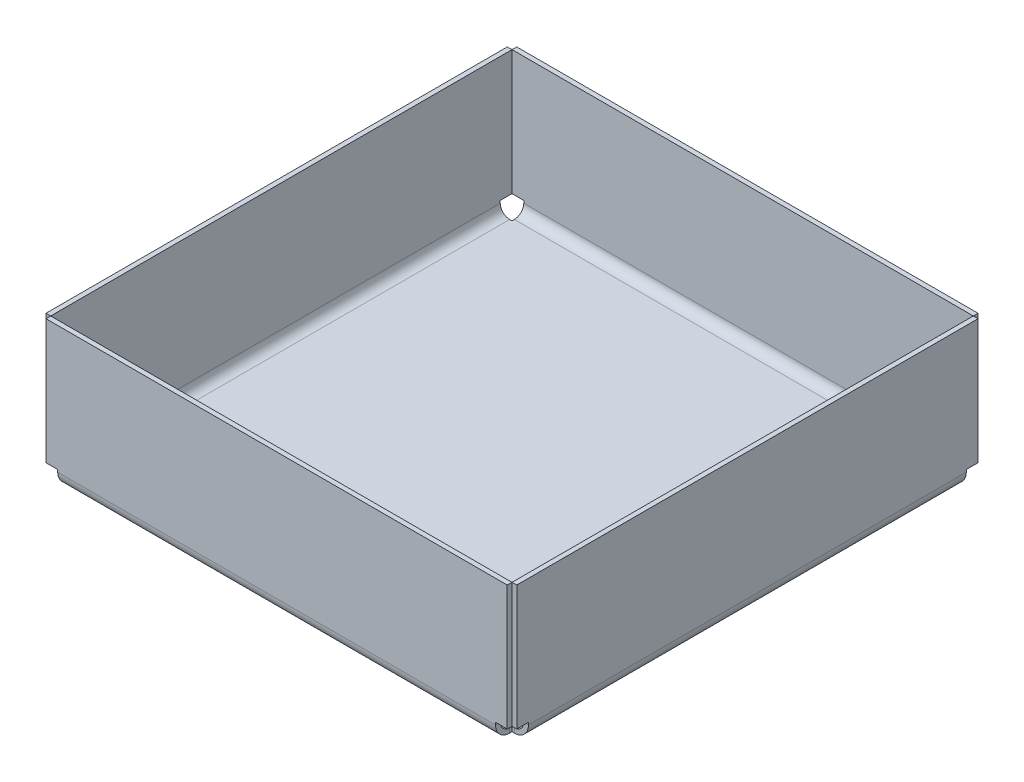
ISO-10303-21;
HEADER;
FILE_DESCRIPTION(('STEP AP214'),'2;1');
FILE_NAME('part.step','',(''),(''),'','','');
FILE_SCHEMA(('AUTOMOTIVE_DESIGN { 1 0 10303 214 1 1 1 1 }'));
ENDSEC;
DATA;
#1=APPLICATION_CONTEXT('core data for automotive mechanical design processes');
#2=APPLICATION_PROTOCOL_DEFINITION('international standard','automotive_design',2000,#1);
#3=PRODUCT_CONTEXT('',#1,'mechanical');
#4=PRODUCT('Part','Part','',(#3));
#5=PRODUCT_RELATED_PRODUCT_CATEGORY('part','',(#4));
#6=PRODUCT_DEFINITION_FORMATION('','',#4);
#7=PRODUCT_DEFINITION_CONTEXT('part definition',#1,'design');
#8=PRODUCT_DEFINITION('design','',#6,#7);
#9=PRODUCT_DEFINITION_SHAPE('','',#8);
#10=(LENGTH_UNIT() NAMED_UNIT(*) SI_UNIT(.MILLI.,.METRE.));
#11=(NAMED_UNIT(*) PLANE_ANGLE_UNIT() SI_UNIT($,.RADIAN.));
#12=(NAMED_UNIT(*) SI_UNIT($,.STERADIAN.) SOLID_ANGLE_UNIT());
#13=UNCERTAINTY_MEASURE_WITH_UNIT(LENGTH_MEASURE(1.E-05),#10,'distance_accuracy_value','');
#14=(GEOMETRIC_REPRESENTATION_CONTEXT(3) GLOBAL_UNCERTAINTY_ASSIGNED_CONTEXT((#13)) GLOBAL_UNIT_ASSIGNED_CONTEXT((#10,
#11,#12)) REPRESENTATION_CONTEXT('',''));
#15=CARTESIAN_POINT('',(0.,0.,0.));
#16=DIRECTION('',(0.,0.,1.));
#17=DIRECTION('',(1.,0.,0.));
#18=AXIS2_PLACEMENT_3D('',#15,#16,#17);
#19=CARTESIAN_POINT('',(204.264167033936,1.,-98.99));
#20=DIRECTION('',(0.,0.,1.));
#21=DIRECTION('',(0.,-1.,0.));
#22=AXIS2_PLACEMENT_3D('',#19,#20,#21);
#23=PLANE('',#22);
#24=DIRECTION('',(-1.,0.,0.));
#25=VECTOR('',#24,1.);
#26=CARTESIAN_POINT('',(204.264167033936,3.49999999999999,-98.99));
#27=LINE('',#26,#25);
#28=CARTESIAN_POINT('',(1.,3.49999999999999,-98.99));
#29=VERTEX_POINT('',#28);
#30=CARTESIAN_POINT('',(0.,3.49999999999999,-98.99));
#31=VERTEX_POINT('',#30);
#32=EDGE_CURVE('E673',#29,#31,#27,.T.);
#33=ORIENTED_EDGE('',*,*,#32,.T.);
#34=DIRECTION('',(0.,1.,0.));
#35=VECTOR('',#34,1.);
#36=CARTESIAN_POINT('',(0.,0.,-98.99));
#37=LINE('',#36,#35);
#38=CARTESIAN_POINT('',(0.,30.,-98.99));
#39=VERTEX_POINT('',#38);
#40=EDGE_CURVE('E670',#31,#39,#37,.T.);
#41=ORIENTED_EDGE('',*,*,#40,.T.);
#42=DIRECTION('',(-1.,0.,0.));
#43=VECTOR('',#42,1.);
#44=CARTESIAN_POINT('',(204.264167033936,30.,-98.99));
#45=LINE('',#44,#43);
#46=CARTESIAN_POINT('',(0.999999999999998,30.,-98.99));
#47=VERTEX_POINT('',#46);
#48=EDGE_CURVE('E668',#47,#39,#45,.T.);
#49=ORIENTED_EDGE('',*,*,#48,.F.);
#50=DIRECTION('',(0.,1.,0.));
#51=VECTOR('',#50,1.);
#52=CARTESIAN_POINT('',(1.,1.,-98.99));
#53=LINE('',#52,#51);
#54=EDGE_CURVE('E95',#29,#47,#53,.T.);
#55=ORIENTED_EDGE('',*,*,#54,.F.);
#56=EDGE_LOOP('',(#33,#41,#49,#55));
#57=FACE_BOUND('',#56,.T.);
#58=ADVANCED_FACE('F32',(#57),#23,.F.);
#59=CARTESIAN_POINT('',(204.264167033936,30.,-100.));
#60=DIRECTION('',(0.,-1.,0.));
#61=DIRECTION('',(1.,0.,0.));
#62=AXIS2_PLACEMENT_3D('',#59,#60,#61);
#63=PLANE('',#62);
#64=ORIENTED_EDGE('',*,*,#48,.T.);
#65=DIRECTION('',(0.,0.,1.));
#66=VECTOR('',#65,1.);
#67=CARTESIAN_POINT('',(0.,30.,0.));
#68=LINE('',#67,#66);
#69=CARTESIAN_POINT('',(0.,30.,-1.01));
#70=VERTEX_POINT('',#69);
#71=EDGE_CURVE('E665',#39,#70,#68,.T.);
#72=ORIENTED_EDGE('',*,*,#71,.T.);
#73=DIRECTION('',(-1.,0.,0.));
#74=VECTOR('',#73,1.);
#75=CARTESIAN_POINT('',(204.264167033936,30.,-1.01));
#76=LINE('',#75,#74);
#77=CARTESIAN_POINT('',(0.999999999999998,30.,-1.01));
#78=VERTEX_POINT('',#77);
#79=EDGE_CURVE('E660',#78,#70,#76,.T.);
#80=ORIENTED_EDGE('',*,*,#79,.F.);
#81=DIRECTION('',(0.,0.,1.));
#82=VECTOR('',#81,1.);
#83=CARTESIAN_POINT('',(1.,30.,-100.));
#84=LINE('',#83,#82);
#85=EDGE_CURVE('E42',#47,#78,#84,.T.);
#86=ORIENTED_EDGE('',*,*,#85,.F.);
#87=EDGE_LOOP('',(#64,#72,#80,#86));
#88=FACE_BOUND('',#87,.T.);
#89=ADVANCED_FACE('F695',(#88),#63,.F.);
#90=CARTESIAN_POINT('',(204.264167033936,1.,-1.01));
#91=DIRECTION('',(0.,0.,1.));
#92=DIRECTION('',(0.,-1.,0.));
#93=AXIS2_PLACEMENT_3D('',#90,#91,#92);
#94=PLANE('',#93);
#95=DIRECTION('',(0.,1.,0.));
#96=VECTOR('',#95,1.);
#97=CARTESIAN_POINT('',(0.,0.,-1.01));
#98=LINE('',#97,#96);
#99=CARTESIAN_POINT('',(0.,3.49999999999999,-1.01));
#100=VERTEX_POINT('',#99);
#101=EDGE_CURVE('E639',#100,#70,#98,.T.);
#102=ORIENTED_EDGE('',*,*,#101,.F.);
#103=DIRECTION('',(-1.,0.,0.));
#104=VECTOR('',#103,1.);
#105=CARTESIAN_POINT('',(204.264167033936,3.49999999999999,-1.01));
#106=LINE('',#105,#104);
#107=CARTESIAN_POINT('',(1.,3.49999999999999,-1.01));
#108=VERTEX_POINT('',#107);
#109=EDGE_CURVE('E655',#108,#100,#106,.T.);
#110=ORIENTED_EDGE('',*,*,#109,.F.);
#111=DIRECTION('',(0.,1.,0.));
#112=VECTOR('',#111,1.);
#113=CARTESIAN_POINT('',(1.,1.,-1.01));
#114=LINE('',#113,#112);
#115=EDGE_CURVE('E663',#108,#78,#114,.T.);
#116=ORIENTED_EDGE('',*,*,#115,.T.);
#117=ORIENTED_EDGE('',*,*,#79,.T.);
#118=EDGE_LOOP('',(#102,#110,#116,#117));
#119=FACE_BOUND('',#118,.T.);
#120=ADVANCED_FACE('F691',(#119),#94,.T.);
#121=CARTESIAN_POINT('',(204.264167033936,3.49999999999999,0.));
#122=DIRECTION('',(0.,-1.,0.));
#123=DIRECTION('',(1.,0.,0.));
#124=AXIS2_PLACEMENT_3D('',#121,#122,#123);
#125=PLANE('',#124);
#126=DIRECTION('',(0.,0.,1.));
#127=VECTOR('',#126,1.);
#128=CARTESIAN_POINT('',(0.,3.49999999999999,0.));
#129=LINE('',#128,#127);
#130=CARTESIAN_POINT('',(0.,3.49999999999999,-3.49999999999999));
#131=VERTEX_POINT('',#130);
#132=EDGE_CURVE('E641',#131,#100,#129,.T.);
#133=ORIENTED_EDGE('',*,*,#132,.F.);
#134=DIRECTION('',(-1.,0.,0.));
#135=VECTOR('',#134,1.);
#136=CARTESIAN_POINT('',(204.264167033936,3.49999999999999,-3.49999999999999));
#137=LINE('',#136,#135);
#138=CARTESIAN_POINT('',(1.,3.49999999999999,-3.49999999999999));
#139=VERTEX_POINT('',#138);
#140=EDGE_CURVE('E635',#139,#131,#137,.T.);
#141=ORIENTED_EDGE('',*,*,#140,.F.);
#142=DIRECTION('',(0.,0.,1.));
#143=VECTOR('',#142,1.);
#144=CARTESIAN_POINT('',(1.,3.49999999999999,0.));
#145=LINE('',#144,#143);
#146=EDGE_CURVE('E658',#139,#108,#145,.T.);
#147=ORIENTED_EDGE('',*,*,#146,.T.);
#148=ORIENTED_EDGE('',*,*,#109,.T.);
#149=EDGE_LOOP('',(#133,#141,#147,#148));
#150=FACE_BOUND('',#149,.T.);
#151=ADVANCED_FACE('F688',(#150),#125,.T.);
#152=CARTESIAN_POINT('',(204.264167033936,3.49999999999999,0.));
#153=DIRECTION('',(0.,-1.,0.));
#154=DIRECTION('',(1.,0.,0.));
#155=AXIS2_PLACEMENT_3D('',#152,#153,#154);
#156=PLANE('',#155);
#157=DIRECTION('',(0.,0.,1.));
#158=VECTOR('',#157,1.);
#159=CARTESIAN_POINT('',(0.,3.49999999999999,0.));
#160=LINE('',#159,#158);
#161=CARTESIAN_POINT('',(0.,3.49999999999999,-96.5));
#162=VERTEX_POINT('',#161);
#163=EDGE_CURVE('E637',#31,#162,#160,.T.);
#164=ORIENTED_EDGE('',*,*,#163,.F.);
#165=ORIENTED_EDGE('',*,*,#32,.F.);
#166=DIRECTION('',(0.,0.,1.));
#167=VECTOR('',#166,1.);
#168=CARTESIAN_POINT('',(1.,3.49999999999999,0.));
#169=LINE('',#168,#167);
#170=CARTESIAN_POINT('',(1.,3.49999999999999,-96.5));
#171=VERTEX_POINT('',#170);
#172=EDGE_CURVE('E653',#29,#171,#169,.T.);
#173=ORIENTED_EDGE('',*,*,#172,.T.);
#174=DIRECTION('',(-1.,0.,0.));
#175=VECTOR('',#174,1.);
#176=CARTESIAN_POINT('',(204.264167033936,3.49999999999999,-96.5));
#177=LINE('',#176,#175);
#178=EDGE_CURVE('E650',#171,#162,#177,.T.);
#179=ORIENTED_EDGE('',*,*,#178,.T.);
#180=EDGE_LOOP('',(#164,#165,#173,#179));
#181=FACE_BOUND('',#180,.T.);
#182=ADVANCED_FACE('F700',(#181),#156,.T.);
#183=CARTESIAN_POINT('',(204.264167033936,30.,-96.5));
#184=DIRECTION('',(0.,0.,1.));
#185=DIRECTION('',(0.,-1.,0.));
#186=AXIS2_PLACEMENT_3D('',#183,#184,#185);
#187=PLANE('',#186);
#188=DIRECTION('',(-1.,0.,0.));
#189=VECTOR('',#188,1.);
#190=CARTESIAN_POINT('',(204.264167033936,3.,-96.5));
#191=LINE('',#190,#189);
#192=CARTESIAN_POINT('',(1.,3.,-96.5));
#193=VERTEX_POINT('',#192);
#194=CARTESIAN_POINT('',(0.,3.,-96.5));
#195=VERTEX_POINT('',#194);
#196=EDGE_CURVE('E391',#193,#195,#191,.T.);
#197=ORIENTED_EDGE('',*,*,#196,.T.);
#198=DIRECTION('',(0.,1.,0.));
#199=VECTOR('',#198,1.);
#200=CARTESIAN_POINT('',(0.,30.,-96.5));
#201=LINE('',#200,#199);
#202=EDGE_CURVE('E646',#195,#162,#201,.T.);
#203=ORIENTED_EDGE('',*,*,#202,.T.);
#204=ORIENTED_EDGE('',*,*,#178,.F.);
#205=DIRECTION('',(0.,1.,0.));
#206=VECTOR('',#205,1.);
#207=CARTESIAN_POINT('',(1.,30.,-96.5));
#208=LINE('',#207,#206);
#209=EDGE_CURVE('E629',#193,#171,#208,.T.);
#210=ORIENTED_EDGE('',*,*,#209,.F.);
#211=EDGE_LOOP('',(#197,#203,#204,#210));
#212=FACE_BOUND('',#211,.T.);
#213=ADVANCED_FACE('F702',(#212),#187,.F.);
#214=CARTESIAN_POINT('',(0.,30.,0.));
#215=DIRECTION('',(1.,0.,0.));
#216=DIRECTION('',(0.,0.,-1.));
#217=AXIS2_PLACEMENT_3D('',#214,#215,#216);
#218=PLANE('',#217);
#219=ORIENTED_EDGE('',*,*,#202,.F.);
#220=DIRECTION('',(0.,0.,1.));
#221=VECTOR('',#220,1.);
#222=CARTESIAN_POINT('',(0.,3.,-96.5));
#223=LINE('',#222,#221);
#224=CARTESIAN_POINT('',(0.,3.,-3.49999999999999));
#225=VERTEX_POINT('',#224);
#226=EDGE_CURVE('E643',#195,#225,#223,.T.);
#227=ORIENTED_EDGE('',*,*,#226,.T.);
#228=DIRECTION('',(0.,-1.,0.));
#229=VECTOR('',#228,1.);
#230=CARTESIAN_POINT('',(0.,30.,-3.49999999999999));
#231=LINE('',#230,#229);
#232=EDGE_CURVE('E632',#131,#225,#231,.T.);
#233=ORIENTED_EDGE('',*,*,#232,.F.);
#234=ORIENTED_EDGE('',*,*,#132,.T.);
#235=ORIENTED_EDGE('',*,*,#101,.T.);
#236=ORIENTED_EDGE('',*,*,#71,.F.);
#237=ORIENTED_EDGE('',*,*,#40,.F.);
#238=ORIENTED_EDGE('',*,*,#163,.T.);
#239=EDGE_LOOP('',(#219,#227,#233,#234,#235,#236,#237,#238));
#240=FACE_BOUND('',#239,.T.);
#241=ADVANCED_FACE('F694',(#240),#218,.F.);
#242=CARTESIAN_POINT('',(204.264167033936,30.,-3.49999999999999));
#243=DIRECTION('',(0.,0.,-1.));
#244=DIRECTION('',(0.,1.,0.));
#245=AXIS2_PLACEMENT_3D('',#242,#243,#244);
#246=PLANE('',#245);
#247=ORIENTED_EDGE('',*,*,#140,.T.);
#248=ORIENTED_EDGE('',*,*,#232,.T.);
#249=DIRECTION('',(-1.,0.,0.));
#250=VECTOR('',#249,1.);
#251=CARTESIAN_POINT('',(204.264167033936,3.,-3.49999999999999));
#252=LINE('',#251,#250);
#253=CARTESIAN_POINT('',(1.,2.99999999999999,-3.5));
#254=VERTEX_POINT('',#253);
#255=EDGE_CURVE('E674',#254,#225,#252,.T.);
#256=ORIENTED_EDGE('',*,*,#255,.F.);
#257=DIRECTION('',(0.,-1.,0.));
#258=VECTOR('',#257,1.);
#259=CARTESIAN_POINT('',(1.,30.,-3.49999999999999));
#260=LINE('',#259,#258);
#261=EDGE_CURVE('E11',#139,#254,#260,.T.);
#262=ORIENTED_EDGE('',*,*,#261,.F.);
#263=EDGE_LOOP('',(#247,#248,#256,#262));
#264=FACE_BOUND('',#263,.T.);
#265=ADVANCED_FACE('F682',(#264),#246,.F.);
#266=CARTESIAN_POINT('',(1.,30.,0.));
#267=DIRECTION('',(1.,0.,0.));
#268=DIRECTION('',(0.,0.,-1.));
#269=AXIS2_PLACEMENT_3D('',#266,#267,#268);
#270=PLANE('',#269);
#271=DIRECTION('',(0.,0.,1.));
#272=VECTOR('',#271,1.);
#273=CARTESIAN_POINT('',(1.,3.,-96.5));
#274=LINE('',#273,#272);
#275=EDGE_CURVE('E36',#193,#254,#274,.T.);
#276=ORIENTED_EDGE('',*,*,#275,.F.);
#277=ORIENTED_EDGE('',*,*,#209,.T.);
#278=ORIENTED_EDGE('',*,*,#172,.F.);
#279=ORIENTED_EDGE('',*,*,#54,.T.);
#280=ORIENTED_EDGE('',*,*,#85,.T.);
#281=ORIENTED_EDGE('',*,*,#115,.F.);
#282=ORIENTED_EDGE('',*,*,#146,.F.);
#283=ORIENTED_EDGE('',*,*,#261,.T.);
#284=EDGE_LOOP('',(#276,#277,#278,#279,#280,#281,#282,#283));
#285=FACE_BOUND('',#284,.T.);
#286=ADVANCED_FACE('F34',(#285),#270,.T.);
#287=CARTESIAN_POINT('',(1.01,1.,-204.264167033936));
#288=DIRECTION('',(1.,0.,0.));
#289=DIRECTION('',(0.,-1.,0.));
#290=AXIS2_PLACEMENT_3D('',#287,#288,#289);
#291=PLANE('',#290);
#292=DIRECTION('',(0.,0.,1.));
#293=VECTOR('',#292,1.);
#294=CARTESIAN_POINT('',(1.01,3.49999999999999,-204.264167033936));
#295=LINE('',#294,#293);
#296=CARTESIAN_POINT('',(1.01,3.49999999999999,-1.));
#297=VERTEX_POINT('',#296);
#298=CARTESIAN_POINT('',(1.01,3.49999999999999,0.));
#299=VERTEX_POINT('',#298);
#300=EDGE_CURVE('E621',#297,#299,#295,.T.);
#301=ORIENTED_EDGE('',*,*,#300,.T.);
#302=DIRECTION('',(0.,1.,0.));
#303=VECTOR('',#302,1.);
#304=CARTESIAN_POINT('',(1.01,0.,0.));
#305=LINE('',#304,#303);
#306=CARTESIAN_POINT('',(1.01,30.,0.));
#307=VERTEX_POINT('',#306);
#308=EDGE_CURVE('E618',#299,#307,#305,.T.);
#309=ORIENTED_EDGE('',*,*,#308,.T.);
#310=DIRECTION('',(0.,0.,1.));
#311=VECTOR('',#310,1.);
#312=CARTESIAN_POINT('',(1.01,30.,-204.264167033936));
#313=LINE('',#312,#311);
#314=CARTESIAN_POINT('',(1.01,30.,-0.999999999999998));
#315=VERTEX_POINT('',#314);
#316=EDGE_CURVE('E616',#315,#307,#313,.T.);
#317=ORIENTED_EDGE('',*,*,#316,.F.);
#318=DIRECTION('',(0.,1.,0.));
#319=VECTOR('',#318,1.);
#320=CARTESIAN_POINT('',(1.01,1.,-1.));
#321=LINE('',#320,#319);
#322=EDGE_CURVE('E151',#297,#315,#321,.T.);
#323=ORIENTED_EDGE('',*,*,#322,.F.);
#324=EDGE_LOOP('',(#301,#309,#317,#323));
#325=FACE_BOUND('',#324,.T.);
#326=ADVANCED_FACE('F866',(#325),#291,.F.);
#327=CARTESIAN_POINT('',(0.,30.,-204.264167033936));
#328=DIRECTION('',(0.,-1.,0.));
#329=DIRECTION('',(0.,0.,-1.));
#330=AXIS2_PLACEMENT_3D('',#327,#328,#329);
#331=PLANE('',#330);
#332=ORIENTED_EDGE('',*,*,#316,.T.);
#333=DIRECTION('',(1.,0.,0.));
#334=VECTOR('',#333,1.);
#335=CARTESIAN_POINT('',(0.,30.,0.));
#336=LINE('',#335,#334);
#337=CARTESIAN_POINT('',(98.99,30.,0.));
#338=VERTEX_POINT('',#337);
#339=EDGE_CURVE('E613',#307,#338,#336,.T.);
#340=ORIENTED_EDGE('',*,*,#339,.T.);
#341=DIRECTION('',(0.,0.,1.));
#342=VECTOR('',#341,1.);
#343=CARTESIAN_POINT('',(98.99,30.,-204.264167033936));
#344=LINE('',#343,#342);
#345=CARTESIAN_POINT('',(98.99,30.,-0.999999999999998));
#346=VERTEX_POINT('',#345);
#347=EDGE_CURVE('E608',#346,#338,#344,.T.);
#348=ORIENTED_EDGE('',*,*,#347,.F.);
#349=DIRECTION('',(1.,0.,0.));
#350=VECTOR('',#349,1.);
#351=CARTESIAN_POINT('',(0.,30.,-1.));
#352=LINE('',#351,#350);
#353=EDGE_CURVE('E144',#315,#346,#352,.T.);
#354=ORIENTED_EDGE('',*,*,#353,.F.);
#355=EDGE_LOOP('',(#332,#340,#348,#354));
#356=FACE_BOUND('',#355,.T.);
#357=ADVANCED_FACE('F870',(#356),#331,.F.);
#358=CARTESIAN_POINT('',(98.99,1.,-204.264167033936));
#359=DIRECTION('',(1.,0.,0.));
#360=DIRECTION('',(0.,-1.,0.));
#361=AXIS2_PLACEMENT_3D('',#358,#359,#360);
#362=PLANE('',#361);
#363=DIRECTION('',(0.,1.,0.));
#364=VECTOR('',#363,1.);
#365=CARTESIAN_POINT('',(98.99,0.,0.));
#366=LINE('',#365,#364);
#367=CARTESIAN_POINT('',(98.99,3.49999999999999,0.));
#368=VERTEX_POINT('',#367);
#369=EDGE_CURVE('E585',#368,#338,#366,.T.);
#370=ORIENTED_EDGE('',*,*,#369,.F.);
#371=DIRECTION('',(0.,0.,1.));
#372=VECTOR('',#371,1.);
#373=CARTESIAN_POINT('',(98.99,3.49999999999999,-204.264167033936));
#374=LINE('',#373,#372);
#375=CARTESIAN_POINT('',(98.99,3.49999999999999,-1.));
#376=VERTEX_POINT('',#375);
#377=EDGE_CURVE('E603',#376,#368,#374,.T.);
#378=ORIENTED_EDGE('',*,*,#377,.F.);
#379=DIRECTION('',(0.,1.,0.));
#380=VECTOR('',#379,1.);
#381=CARTESIAN_POINT('',(98.99,1.,-1.));
#382=LINE('',#381,#380);
#383=EDGE_CURVE('E611',#376,#346,#382,.T.);
#384=ORIENTED_EDGE('',*,*,#383,.T.);
#385=ORIENTED_EDGE('',*,*,#347,.T.);
#386=EDGE_LOOP('',(#370,#378,#384,#385));
#387=FACE_BOUND('',#386,.T.);
#388=ADVANCED_FACE('F875',(#387),#362,.T.);
#389=CARTESIAN_POINT('',(0.,3.49999999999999,-204.264167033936));
#390=DIRECTION('',(0.,-1.,0.));
#391=DIRECTION('',(0.,0.,-1.));
#392=AXIS2_PLACEMENT_3D('',#389,#390,#391);
#393=PLANE('',#392);
#394=DIRECTION('',(1.,0.,0.));
#395=VECTOR('',#394,1.);
#396=CARTESIAN_POINT('',(0.,3.49999999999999,0.));
#397=LINE('',#396,#395);
#398=CARTESIAN_POINT('',(96.5,3.49999999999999,0.));
#399=VERTEX_POINT('',#398);
#400=EDGE_CURVE('E587',#399,#368,#397,.T.);
#401=ORIENTED_EDGE('',*,*,#400,.F.);
#402=DIRECTION('',(0.,0.,1.));
#403=VECTOR('',#402,1.);
#404=CARTESIAN_POINT('',(96.5,3.49999999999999,-204.264167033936));
#405=LINE('',#404,#403);
#406=CARTESIAN_POINT('',(96.5,3.49999999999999,-1.));
#407=VERTEX_POINT('',#406);
#408=EDGE_CURVE('E581',#407,#399,#405,.T.);
#409=ORIENTED_EDGE('',*,*,#408,.F.);
#410=DIRECTION('',(1.,0.,0.));
#411=VECTOR('',#410,1.);
#412=CARTESIAN_POINT('',(0.,3.49999999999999,-1.));
#413=LINE('',#412,#411);
#414=EDGE_CURVE('E606',#407,#376,#413,.T.);
#415=ORIENTED_EDGE('',*,*,#414,.T.);
#416=ORIENTED_EDGE('',*,*,#377,.T.);
#417=EDGE_LOOP('',(#401,#409,#415,#416));
#418=FACE_BOUND('',#417,.T.);
#419=ADVANCED_FACE('F882',(#418),#393,.T.);
#420=CARTESIAN_POINT('',(0.,3.49999999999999,-204.264167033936));
#421=DIRECTION('',(0.,-1.,0.));
#422=DIRECTION('',(0.,0.,-1.));
#423=AXIS2_PLACEMENT_3D('',#420,#421,#422);
#424=PLANE('',#423);
#425=DIRECTION('',(1.,0.,0.));
#426=VECTOR('',#425,1.);
#427=CARTESIAN_POINT('',(0.,3.49999999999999,0.));
#428=LINE('',#427,#426);
#429=CARTESIAN_POINT('',(3.49999999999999,3.49999999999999,0.));
#430=VERTEX_POINT('',#429);
#431=EDGE_CURVE('E583',#299,#430,#428,.T.);
#432=ORIENTED_EDGE('',*,*,#431,.F.);
#433=ORIENTED_EDGE('',*,*,#300,.F.);
#434=DIRECTION('',(1.,0.,0.));
#435=VECTOR('',#434,1.);
#436=CARTESIAN_POINT('',(0.,3.49999999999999,-1.));
#437=LINE('',#436,#435);
#438=CARTESIAN_POINT('',(3.49999999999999,3.49999999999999,-1.));
#439=VERTEX_POINT('',#438);
#440=EDGE_CURVE('E601',#297,#439,#437,.T.);
#441=ORIENTED_EDGE('',*,*,#440,.T.);
#442=DIRECTION('',(0.,0.,1.));
#443=VECTOR('',#442,1.);
#444=CARTESIAN_POINT('',(3.49999999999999,3.49999999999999,-204.264167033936));
#445=LINE('',#444,#443);
#446=EDGE_CURVE('E598',#439,#430,#445,.T.);
#447=ORIENTED_EDGE('',*,*,#446,.T.);
#448=EDGE_LOOP('',(#432,#433,#441,#447));
#449=FACE_BOUND('',#448,.T.);
#450=ADVANCED_FACE('F886',(#449),#424,.T.);
#451=CARTESIAN_POINT('',(3.49999999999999,30.,-204.264167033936));
#452=DIRECTION('',(1.,0.,0.));
#453=DIRECTION('',(0.,-1.,0.));
#454=AXIS2_PLACEMENT_3D('',#451,#452,#453);
#455=PLANE('',#454);
#456=DIRECTION('',(0.,0.,1.));
#457=VECTOR('',#456,1.);
#458=CARTESIAN_POINT('',(3.49999999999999,3.,-204.264167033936));
#459=LINE('',#458,#457);
#460=CARTESIAN_POINT('',(3.49999999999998,3.,-1.));
#461=VERTEX_POINT('',#460);
#462=CARTESIAN_POINT('',(3.49999999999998,3.,0.));
#463=VERTEX_POINT('',#462);
#464=EDGE_CURVE('E595',#461,#463,#459,.T.);
#465=ORIENTED_EDGE('',*,*,#464,.T.);
#466=DIRECTION('',(0.,1.,0.));
#467=VECTOR('',#466,1.);
#468=CARTESIAN_POINT('',(3.49999999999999,30.,0.));
#469=LINE('',#468,#467);
#470=EDGE_CURVE('E592',#463,#430,#469,.T.);
#471=ORIENTED_EDGE('',*,*,#470,.T.);
#472=ORIENTED_EDGE('',*,*,#446,.F.);
#473=DIRECTION('',(0.,1.,0.));
#474=VECTOR('',#473,1.);
#475=CARTESIAN_POINT('',(3.49999999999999,30.,-1.));
#476=LINE('',#475,#474);
#477=EDGE_CURVE('E575',#461,#439,#476,.T.);
#478=ORIENTED_EDGE('',*,*,#477,.F.);
#479=EDGE_LOOP('',(#465,#471,#472,#478));
#480=FACE_BOUND('',#479,.T.);
#481=ADVANCED_FACE('F890',(#480),#455,.F.);
#482=CARTESIAN_POINT('',(0.,30.,0.));
#483=DIRECTION('',(0.,0.,-1.));
#484=DIRECTION('',(-1.,0.,0.));
#485=AXIS2_PLACEMENT_3D('',#482,#483,#484);
#486=PLANE('',#485);
#487=ORIENTED_EDGE('',*,*,#470,.F.);
#488=DIRECTION('',(1.,0.,0.));
#489=VECTOR('',#488,1.);
#490=CARTESIAN_POINT('',(3.49999999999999,3.,0.));
#491=LINE('',#490,#489);
#492=CARTESIAN_POINT('',(96.5,3.,0.));
#493=VERTEX_POINT('',#492);
#494=EDGE_CURVE('E589',#463,#493,#491,.T.);
#495=ORIENTED_EDGE('',*,*,#494,.T.);
#496=DIRECTION('',(0.,-1.,0.));
#497=VECTOR('',#496,1.);
#498=CARTESIAN_POINT('',(96.5,30.,0.));
#499=LINE('',#498,#497);
#500=EDGE_CURVE('E578',#399,#493,#499,.T.);
#501=ORIENTED_EDGE('',*,*,#500,.F.);
#502=ORIENTED_EDGE('',*,*,#400,.T.);
#503=ORIENTED_EDGE('',*,*,#369,.T.);
#504=ORIENTED_EDGE('',*,*,#339,.F.);
#505=ORIENTED_EDGE('',*,*,#308,.F.);
#506=ORIENTED_EDGE('',*,*,#431,.T.);
#507=EDGE_LOOP('',(#487,#495,#501,#502,#503,#504,#505,#506));
#508=FACE_BOUND('',#507,.T.);
#509=ADVANCED_FACE('F894',(#508),#486,.F.);
#510=CARTESIAN_POINT('',(96.5,30.,-204.264167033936));
#511=DIRECTION('',(-1.,0.,0.));
#512=DIRECTION('',(0.,1.,0.));
#513=AXIS2_PLACEMENT_3D('',#510,#511,#512);
#514=PLANE('',#513);
#515=ORIENTED_EDGE('',*,*,#408,.T.);
#516=ORIENTED_EDGE('',*,*,#500,.T.);
#517=DIRECTION('',(0.,0.,1.));
#518=VECTOR('',#517,1.);
#519=CARTESIAN_POINT('',(96.5,3.,-204.264167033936));
#520=LINE('',#519,#518);
#521=CARTESIAN_POINT('',(96.5,2.99999999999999,-1.));
#522=VERTEX_POINT('',#521);
#523=EDGE_CURVE('E623',#522,#493,#520,.T.);
#524=ORIENTED_EDGE('',*,*,#523,.F.);
#525=DIRECTION('',(0.,-1.,0.));
#526=VECTOR('',#525,1.);
#527=CARTESIAN_POINT('',(96.5,30.,-1.));
#528=LINE('',#527,#526);
#529=EDGE_CURVE('E104',#407,#522,#528,.T.);
#530=ORIENTED_EDGE('',*,*,#529,.F.);
#531=EDGE_LOOP('',(#515,#516,#524,#530));
#532=FACE_BOUND('',#531,.T.);
#533=ADVANCED_FACE('F897',(#532),#514,.F.);
#534=CARTESIAN_POINT('',(0.,30.,-1.));
#535=DIRECTION('',(0.,0.,-1.));
#536=DIRECTION('',(-1.,0.,0.));
#537=AXIS2_PLACEMENT_3D('',#534,#535,#536);
#538=PLANE('',#537);
#539=DIRECTION('',(1.,0.,0.));
#540=VECTOR('',#539,1.);
#541=CARTESIAN_POINT('',(3.49999999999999,3.,-1.));
#542=LINE('',#541,#540);
#543=EDGE_CURVE('E517',#461,#522,#542,.T.);
#544=ORIENTED_EDGE('',*,*,#543,.F.);
#545=ORIENTED_EDGE('',*,*,#477,.T.);
#546=ORIENTED_EDGE('',*,*,#440,.F.);
#547=ORIENTED_EDGE('',*,*,#322,.T.);
#548=ORIENTED_EDGE('',*,*,#353,.T.);
#549=ORIENTED_EDGE('',*,*,#383,.F.);
#550=ORIENTED_EDGE('',*,*,#414,.F.);
#551=ORIENTED_EDGE('',*,*,#529,.T.);
#552=EDGE_LOOP('',(#544,#545,#546,#547,#548,#549,#550,#551));
#553=FACE_BOUND('',#552,.T.);
#554=ADVANCED_FACE('F850',(#553),#538,.T.);
#555=CARTESIAN_POINT('',(-104.264167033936,1.,-1.01));
#556=DIRECTION('',(0.,0.,-1.));
#557=DIRECTION('',(0.,-1.,0.));
#558=AXIS2_PLACEMENT_3D('',#555,#556,#557);
#559=PLANE('',#558);
#560=DIRECTION('',(1.,0.,0.));
#561=VECTOR('',#560,1.);
#562=CARTESIAN_POINT('',(-104.264167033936,3.49999999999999,-1.01));
#563=LINE('',#562,#561);
#564=CARTESIAN_POINT('',(99.,3.49999999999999,-1.01));
#565=VERTEX_POINT('',#564);
#566=CARTESIAN_POINT('',(100.,3.49999999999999,-1.01));
#567=VERTEX_POINT('',#566);
#568=EDGE_CURVE('E566',#565,#567,#563,.T.);
#569=ORIENTED_EDGE('',*,*,#568,.T.);
#570=DIRECTION('',(0.,1.,0.));
#571=VECTOR('',#570,1.);
#572=CARTESIAN_POINT('',(100.,0.,-1.01));
#573=LINE('',#572,#571);
#574=CARTESIAN_POINT('',(100.,30.,-1.01));
#575=VERTEX_POINT('',#574);
#576=EDGE_CURVE('E563',#567,#575,#573,.T.);
#577=ORIENTED_EDGE('',*,*,#576,.T.);
#578=DIRECTION('',(1.,0.,0.));
#579=VECTOR('',#578,1.);
#580=CARTESIAN_POINT('',(-104.264167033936,30.,-1.01));
#581=LINE('',#580,#579);
#582=CARTESIAN_POINT('',(99.,30.,-1.01));
#583=VERTEX_POINT('',#582);
#584=EDGE_CURVE('E561',#583,#575,#581,.T.);
#585=ORIENTED_EDGE('',*,*,#584,.F.);
#586=DIRECTION('',(0.,1.,0.));
#587=VECTOR('',#586,1.);
#588=CARTESIAN_POINT('',(99.,1.,-1.01));
#589=LINE('',#588,#587);
#590=EDGE_CURVE('E207',#565,#583,#589,.T.);
#591=ORIENTED_EDGE('',*,*,#590,.F.);
#592=EDGE_LOOP('',(#569,#577,#585,#591));
#593=FACE_BOUND('',#592,.T.);
#594=ADVANCED_FACE('F832',(#593),#559,.F.);
#595=CARTESIAN_POINT('',(-104.264167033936,30.,-100.));
#596=DIRECTION('',(0.,-1.,0.));
#597=DIRECTION('',(1.,0.,0.));
#598=AXIS2_PLACEMENT_3D('',#595,#596,#597);
#599=PLANE('',#598);
#600=ORIENTED_EDGE('',*,*,#584,.T.);
#601=DIRECTION('',(0.,0.,-1.));
#602=VECTOR('',#601,1.);
#603=CARTESIAN_POINT('',(100.,30.,0.));
#604=LINE('',#603,#602);
#605=CARTESIAN_POINT('',(100.,30.,-98.99));
#606=VERTEX_POINT('',#605);
#607=EDGE_CURVE('E558',#575,#606,#604,.T.);
#608=ORIENTED_EDGE('',*,*,#607,.T.);
#609=DIRECTION('',(1.,0.,0.));
#610=VECTOR('',#609,1.);
#611=CARTESIAN_POINT('',(-104.264167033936,30.,-98.99));
#612=LINE('',#611,#610);
#613=CARTESIAN_POINT('',(99.,30.,-98.99));
#614=VERTEX_POINT('',#613);
#615=EDGE_CURVE('E553',#614,#606,#612,.T.);
#616=ORIENTED_EDGE('',*,*,#615,.F.);
#617=DIRECTION('',(0.,0.,-1.));
#618=VECTOR('',#617,1.);
#619=CARTESIAN_POINT('',(99.,30.,-100.));
#620=LINE('',#619,#618);
#621=EDGE_CURVE('E200',#583,#614,#620,.T.);
#622=ORIENTED_EDGE('',*,*,#621,.F.);
#623=EDGE_LOOP('',(#600,#608,#616,#622));
#624=FACE_BOUND('',#623,.T.);
#625=ADVANCED_FACE('F831',(#624),#599,.F.);
#626=CARTESIAN_POINT('',(-104.264167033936,1.,-98.99));
#627=DIRECTION('',(0.,0.,-1.));
#628=DIRECTION('',(0.,-1.,0.));
#629=AXIS2_PLACEMENT_3D('',#626,#627,#628);
#630=PLANE('',#629);
#631=DIRECTION('',(0.,1.,0.));
#632=VECTOR('',#631,1.);
#633=CARTESIAN_POINT('',(100.,0.,-98.99));
#634=LINE('',#633,#632);
#635=CARTESIAN_POINT('',(100.,3.49999999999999,-98.99));
#636=VERTEX_POINT('',#635);
#637=EDGE_CURVE('E530',#636,#606,#634,.T.);
#638=ORIENTED_EDGE('',*,*,#637,.F.);
#639=DIRECTION('',(1.,0.,0.));
#640=VECTOR('',#639,1.);
#641=CARTESIAN_POINT('',(-104.264167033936,3.49999999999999,-98.99));
#642=LINE('',#641,#640);
#643=CARTESIAN_POINT('',(99.,3.49999999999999,-98.99));
#644=VERTEX_POINT('',#643);
#645=EDGE_CURVE('E548',#644,#636,#642,.T.);
#646=ORIENTED_EDGE('',*,*,#645,.F.);
#647=DIRECTION('',(0.,1.,0.));
#648=VECTOR('',#647,1.);
#649=CARTESIAN_POINT('',(99.,1.,-98.99));
#650=LINE('',#649,#648);
#651=EDGE_CURVE('E556',#644,#614,#650,.T.);
#652=ORIENTED_EDGE('',*,*,#651,.T.);
#653=ORIENTED_EDGE('',*,*,#615,.T.);
#654=EDGE_LOOP('',(#638,#646,#652,#653));
#655=FACE_BOUND('',#654,.T.);
#656=ADVANCED_FACE('F830',(#655),#630,.T.);
#657=CARTESIAN_POINT('',(-104.264167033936,3.49999999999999,0.));
#658=DIRECTION('',(0.,-1.,0.));
#659=DIRECTION('',(1.,0.,0.));
#660=AXIS2_PLACEMENT_3D('',#657,#658,#659);
#661=PLANE('',#660);
#662=DIRECTION('',(0.,0.,-1.));
#663=VECTOR('',#662,1.);
#664=CARTESIAN_POINT('',(100.,3.49999999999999,0.));
#665=LINE('',#664,#663);
#666=CARTESIAN_POINT('',(100.,3.49999999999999,-96.5));
#667=VERTEX_POINT('',#666);
#668=EDGE_CURVE('E532',#667,#636,#665,.T.);
#669=ORIENTED_EDGE('',*,*,#668,.F.);
#670=DIRECTION('',(1.,0.,0.));
#671=VECTOR('',#670,1.);
#672=CARTESIAN_POINT('',(-104.264167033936,3.49999999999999,-96.5));
#673=LINE('',#672,#671);
#674=CARTESIAN_POINT('',(99.,3.49999999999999,-96.5));
#675=VERTEX_POINT('',#674);
#676=EDGE_CURVE('E526',#675,#667,#673,.T.);
#677=ORIENTED_EDGE('',*,*,#676,.F.);
#678=DIRECTION('',(0.,0.,-1.));
#679=VECTOR('',#678,1.);
#680=CARTESIAN_POINT('',(99.,3.49999999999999,0.));
#681=LINE('',#680,#679);
#682=EDGE_CURVE('E551',#675,#644,#681,.T.);
#683=ORIENTED_EDGE('',*,*,#682,.T.);
#684=ORIENTED_EDGE('',*,*,#645,.T.);
#685=EDGE_LOOP('',(#669,#677,#683,#684));
#686=FACE_BOUND('',#685,.T.);
#687=ADVANCED_FACE('F825',(#686),#661,.T.);
#688=CARTESIAN_POINT('',(-104.264167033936,3.49999999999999,0.));
#689=DIRECTION('',(0.,-1.,0.));
#690=DIRECTION('',(1.,0.,0.));
#691=AXIS2_PLACEMENT_3D('',#688,#689,#690);
#692=PLANE('',#691);
#693=DIRECTION('',(0.,0.,-1.));
#694=VECTOR('',#693,1.);
#695=CARTESIAN_POINT('',(100.,3.49999999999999,0.));
#696=LINE('',#695,#694);
#697=CARTESIAN_POINT('',(100.,3.49999999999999,-3.49999999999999));
#698=VERTEX_POINT('',#697);
#699=EDGE_CURVE('E528',#567,#698,#696,.T.);
#700=ORIENTED_EDGE('',*,*,#699,.F.);
#701=ORIENTED_EDGE('',*,*,#568,.F.);
#702=DIRECTION('',(0.,0.,-1.));
#703=VECTOR('',#702,1.);
#704=CARTESIAN_POINT('',(99.,3.49999999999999,0.));
#705=LINE('',#704,#703);
#706=CARTESIAN_POINT('',(99.,3.49999999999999,-3.49999999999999));
#707=VERTEX_POINT('',#706);
#708=EDGE_CURVE('E546',#565,#707,#705,.T.);
#709=ORIENTED_EDGE('',*,*,#708,.T.);
#710=DIRECTION('',(1.,0.,0.));
#711=VECTOR('',#710,1.);
#712=CARTESIAN_POINT('',(-104.264167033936,3.49999999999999,-3.49999999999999));
#713=LINE('',#712,#711);
#714=EDGE_CURVE('E543',#707,#698,#713,.T.);
#715=ORIENTED_EDGE('',*,*,#714,.T.);
#716=EDGE_LOOP('',(#700,#701,#709,#715));
#717=FACE_BOUND('',#716,.T.);
#718=ADVANCED_FACE('F834',(#717),#692,.T.);
#719=CARTESIAN_POINT('',(-104.264167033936,30.,-3.49999999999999));
#720=DIRECTION('',(0.,0.,-1.));
#721=DIRECTION('',(0.,-1.,0.));
#722=AXIS2_PLACEMENT_3D('',#719,#720,#721);
#723=PLANE('',#722);
#724=DIRECTION('',(1.,0.,0.));
#725=VECTOR('',#724,1.);
#726=CARTESIAN_POINT('',(-104.264167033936,3.,-3.49999999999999));
#727=LINE('',#726,#725);
#728=CARTESIAN_POINT('',(99.,3.,-3.49999999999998));
#729=VERTEX_POINT('',#728);
#730=CARTESIAN_POINT('',(100.,3.,-3.49999999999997));
#731=VERTEX_POINT('',#730);
#732=EDGE_CURVE('E540',#729,#731,#727,.T.);
#733=ORIENTED_EDGE('',*,*,#732,.T.);
#734=DIRECTION('',(0.,1.,0.));
#735=VECTOR('',#734,1.);
#736=CARTESIAN_POINT('',(100.,30.,-3.49999999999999));
#737=LINE('',#736,#735);
#738=EDGE_CURVE('E537',#731,#698,#737,.T.);
#739=ORIENTED_EDGE('',*,*,#738,.T.);
#740=ORIENTED_EDGE('',*,*,#714,.F.);
#741=DIRECTION('',(0.,1.,0.));
#742=VECTOR('',#741,1.);
#743=CARTESIAN_POINT('',(99.,30.,-3.49999999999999));
#744=LINE('',#743,#742);
#745=EDGE_CURVE('E520',#729,#707,#744,.T.);
#746=ORIENTED_EDGE('',*,*,#745,.F.);
#747=EDGE_LOOP('',(#733,#739,#740,#746));
#748=FACE_BOUND('',#747,.T.);
#749=ADVANCED_FACE('F815',(#748),#723,.F.);
#750=CARTESIAN_POINT('',(100.,30.,0.));
#751=DIRECTION('',(-1.,0.,0.));
#752=DIRECTION('',(0.,0.,1.));
#753=AXIS2_PLACEMENT_3D('',#750,#751,#752);
#754=PLANE('',#753);
#755=ORIENTED_EDGE('',*,*,#738,.F.);
#756=DIRECTION('',(0.,0.,-1.));
#757=VECTOR('',#756,1.);
#758=CARTESIAN_POINT('',(100.,3.,-3.49999999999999));
#759=LINE('',#758,#757);
#760=CARTESIAN_POINT('',(100.,3.,-96.5));
#761=VERTEX_POINT('',#760);
#762=EDGE_CURVE('E534',#731,#761,#759,.T.);
#763=ORIENTED_EDGE('',*,*,#762,.T.);
#764=DIRECTION('',(0.,-1.,0.));
#765=VECTOR('',#764,1.);
#766=CARTESIAN_POINT('',(100.,30.,-96.5));
#767=LINE('',#766,#765);
#768=EDGE_CURVE('E523',#667,#761,#767,.T.);
#769=ORIENTED_EDGE('',*,*,#768,.F.);
#770=ORIENTED_EDGE('',*,*,#668,.T.);
#771=ORIENTED_EDGE('',*,*,#637,.T.);
#772=ORIENTED_EDGE('',*,*,#607,.F.);
#773=ORIENTED_EDGE('',*,*,#576,.F.);
#774=ORIENTED_EDGE('',*,*,#699,.T.);
#775=EDGE_LOOP('',(#755,#763,#769,#770,#771,#772,#773,#774));
#776=FACE_BOUND('',#775,.T.);
#777=ADVANCED_FACE('F810',(#776),#754,.F.);
#778=CARTESIAN_POINT('',(-104.264167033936,30.,-96.5));
#779=DIRECTION('',(0.,0.,1.));
#780=DIRECTION('',(0.,1.,0.));
#781=AXIS2_PLACEMENT_3D('',#778,#779,#780);
#782=PLANE('',#781);
#783=ORIENTED_EDGE('',*,*,#676,.T.);
#784=ORIENTED_EDGE('',*,*,#768,.T.);
#785=DIRECTION('',(1.,0.,0.));
#786=VECTOR('',#785,1.);
#787=CARTESIAN_POINT('',(-104.264167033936,3.,-96.5));
#788=LINE('',#787,#786);
#789=CARTESIAN_POINT('',(99.,2.99999999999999,-96.5));
#790=VERTEX_POINT('',#789);
#791=EDGE_CURVE('E568',#790,#761,#788,.T.);
#792=ORIENTED_EDGE('',*,*,#791,.F.);
#793=DIRECTION('',(0.,-1.,0.));
#794=VECTOR('',#793,1.);
#795=CARTESIAN_POINT('',(99.,30.,-96.5));
#796=LINE('',#795,#794);
#797=EDGE_CURVE('E160',#675,#790,#796,.T.);
#798=ORIENTED_EDGE('',*,*,#797,.F.);
#799=EDGE_LOOP('',(#783,#784,#792,#798));
#800=FACE_BOUND('',#799,.T.);
#801=ADVANCED_FACE('F823',(#800),#782,.F.);
#802=CARTESIAN_POINT('',(99.,30.,0.));
#803=DIRECTION('',(-1.,0.,0.));
#804=DIRECTION('',(0.,0.,1.));
#805=AXIS2_PLACEMENT_3D('',#802,#803,#804);
#806=PLANE('',#805);
#807=DIRECTION('',(0.,0.,-1.));
#808=VECTOR('',#807,1.);
#809=CARTESIAN_POINT('',(99.,3.,-3.49999999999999));
#810=LINE('',#809,#808);
#811=EDGE_CURVE('E461',#729,#790,#810,.T.);
#812=ORIENTED_EDGE('',*,*,#811,.F.);
#813=ORIENTED_EDGE('',*,*,#745,.T.);
#814=ORIENTED_EDGE('',*,*,#708,.F.);
#815=ORIENTED_EDGE('',*,*,#590,.T.);
#816=ORIENTED_EDGE('',*,*,#621,.T.);
#817=ORIENTED_EDGE('',*,*,#651,.F.);
#818=ORIENTED_EDGE('',*,*,#682,.F.);
#819=ORIENTED_EDGE('',*,*,#797,.T.);
#820=EDGE_LOOP('',(#812,#813,#814,#815,#816,#817,#818,#819));
#821=FACE_BOUND('',#820,.T.);
#822=ADVANCED_FACE('F819',(#821),#806,.T.);
#823=CARTESIAN_POINT('',(98.99,1.,104.264167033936));
#824=DIRECTION('',(-1.,0.,0.));
#825=DIRECTION('',(0.,-1.,0.));
#826=AXIS2_PLACEMENT_3D('',#823,#824,#825);
#827=PLANE('',#826);
#828=DIRECTION('',(0.,0.,-1.));
#829=VECTOR('',#828,1.);
#830=CARTESIAN_POINT('',(98.99,3.49999999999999,104.264167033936));
#831=LINE('',#830,#829);
#832=CARTESIAN_POINT('',(98.99,3.49999999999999,-99.));
#833=VERTEX_POINT('',#832);
#834=CARTESIAN_POINT('',(98.99,3.49999999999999,-100.));
#835=VERTEX_POINT('',#834);
#836=EDGE_CURVE('E510',#833,#835,#831,.T.);
#837=ORIENTED_EDGE('',*,*,#836,.T.);
#838=DIRECTION('',(0.,1.,0.));
#839=VECTOR('',#838,1.);
#840=CARTESIAN_POINT('',(98.99,0.,-100.));
#841=LINE('',#840,#839);
#842=CARTESIAN_POINT('',(98.99,30.,-100.));
#843=VERTEX_POINT('',#842);
#844=EDGE_CURVE('E507',#835,#843,#841,.T.);
#845=ORIENTED_EDGE('',*,*,#844,.T.);
#846=DIRECTION('',(0.,0.,-1.));
#847=VECTOR('',#846,1.);
#848=CARTESIAN_POINT('',(98.99,30.,104.264167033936));
#849=LINE('',#848,#847);
#850=CARTESIAN_POINT('',(98.99,30.,-99.));
#851=VERTEX_POINT('',#850);
#852=EDGE_CURVE('E505',#851,#843,#849,.T.);
#853=ORIENTED_EDGE('',*,*,#852,.F.);
#854=DIRECTION('',(0.,1.,0.));
#855=VECTOR('',#854,1.);
#856=CARTESIAN_POINT('',(98.99,1.,-99.));
#857=LINE('',#856,#855);
#858=EDGE_CURVE('E262',#833,#851,#857,.T.);
#859=ORIENTED_EDGE('',*,*,#858,.F.);
#860=EDGE_LOOP('',(#837,#845,#853,#859));
#861=FACE_BOUND('',#860,.T.);
#862=ADVANCED_FACE('F1000',(#861),#827,.F.);
#863=CARTESIAN_POINT('',(0.,30.,104.264167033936));
#864=DIRECTION('',(0.,-1.,0.));
#865=DIRECTION('',(0.,0.,-1.));
#866=AXIS2_PLACEMENT_3D('',#863,#864,#865);
#867=PLANE('',#866);
#868=ORIENTED_EDGE('',*,*,#852,.T.);
#869=DIRECTION('',(-1.,0.,0.));
#870=VECTOR('',#869,1.);
#871=CARTESIAN_POINT('',(0.,30.,-100.));
#872=LINE('',#871,#870);
#873=CARTESIAN_POINT('',(1.01,30.,-100.));
#874=VERTEX_POINT('',#873);
#875=EDGE_CURVE('E502',#843,#874,#872,.T.);
#876=ORIENTED_EDGE('',*,*,#875,.T.);
#877=DIRECTION('',(0.,0.,-1.));
#878=VECTOR('',#877,1.);
#879=CARTESIAN_POINT('',(1.01,30.,104.264167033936));
#880=LINE('',#879,#878);
#881=CARTESIAN_POINT('',(1.01,30.,-99.));
#882=VERTEX_POINT('',#881);
#883=EDGE_CURVE('E497',#882,#874,#880,.T.);
#884=ORIENTED_EDGE('',*,*,#883,.F.);
#885=DIRECTION('',(-1.,0.,0.));
#886=VECTOR('',#885,1.);
#887=CARTESIAN_POINT('',(0.,30.,-99.));
#888=LINE('',#887,#886);
#889=EDGE_CURVE('E256',#851,#882,#888,.T.);
#890=ORIENTED_EDGE('',*,*,#889,.F.);
#891=EDGE_LOOP('',(#868,#876,#884,#890));
#892=FACE_BOUND('',#891,.T.);
#893=ADVANCED_FACE('F1003',(#892),#867,.F.);
#894=CARTESIAN_POINT('',(1.01,1.,104.264167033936));
#895=DIRECTION('',(-1.,0.,0.));
#896=DIRECTION('',(0.,-1.,0.));
#897=AXIS2_PLACEMENT_3D('',#894,#895,#896);
#898=PLANE('',#897);
#899=DIRECTION('',(0.,1.,0.));
#900=VECTOR('',#899,1.);
#901=CARTESIAN_POINT('',(1.01,0.,-100.));
#902=LINE('',#901,#900);
#903=CARTESIAN_POINT('',(1.01,3.49999999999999,-100.));
#904=VERTEX_POINT('',#903);
#905=EDGE_CURVE('E474',#904,#874,#902,.T.);
#906=ORIENTED_EDGE('',*,*,#905,.F.);
#907=DIRECTION('',(0.,0.,-1.));
#908=VECTOR('',#907,1.);
#909=CARTESIAN_POINT('',(1.01,3.49999999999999,104.264167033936));
#910=LINE('',#909,#908);
#911=CARTESIAN_POINT('',(1.01,3.49999999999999,-99.));
#912=VERTEX_POINT('',#911);
#913=EDGE_CURVE('E492',#912,#904,#910,.T.);
#914=ORIENTED_EDGE('',*,*,#913,.F.);
#915=DIRECTION('',(0.,1.,0.));
#916=VECTOR('',#915,1.);
#917=CARTESIAN_POINT('',(1.01,1.,-99.));
#918=LINE('',#917,#916);
#919=EDGE_CURVE('E500',#912,#882,#918,.T.);
#920=ORIENTED_EDGE('',*,*,#919,.T.);
#921=ORIENTED_EDGE('',*,*,#883,.T.);
#922=EDGE_LOOP('',(#906,#914,#920,#921));
#923=FACE_BOUND('',#922,.T.);
#924=ADVANCED_FACE('F1006',(#923),#898,.T.);
#925=CARTESIAN_POINT('',(0.,3.49999999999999,104.264167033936));
#926=DIRECTION('',(0.,-1.,0.));
#927=DIRECTION('',(0.,0.,-1.));
#928=AXIS2_PLACEMENT_3D('',#925,#926,#927);
#929=PLANE('',#928);
#930=DIRECTION('',(-1.,0.,0.));
#931=VECTOR('',#930,1.);
#932=CARTESIAN_POINT('',(0.,3.49999999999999,-100.));
#933=LINE('',#932,#931);
#934=CARTESIAN_POINT('',(3.49999999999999,3.49999999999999,-100.));
#935=VERTEX_POINT('',#934);
#936=EDGE_CURVE('E476',#935,#904,#933,.T.);
#937=ORIENTED_EDGE('',*,*,#936,.F.);
#938=DIRECTION('',(0.,0.,-1.));
#939=VECTOR('',#938,1.);
#940=CARTESIAN_POINT('',(3.49999999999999,3.49999999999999,104.264167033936));
#941=LINE('',#940,#939);
#942=CARTESIAN_POINT('',(3.49999999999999,3.49999999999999,-99.));
#943=VERTEX_POINT('',#942);
#944=EDGE_CURVE('E470',#943,#935,#941,.T.);
#945=ORIENTED_EDGE('',*,*,#944,.F.);
#946=DIRECTION('',(-1.,0.,0.));
#947=VECTOR('',#946,1.);
#948=CARTESIAN_POINT('',(0.,3.49999999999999,-99.));
#949=LINE('',#948,#947);
#950=EDGE_CURVE('E495',#943,#912,#949,.T.);
#951=ORIENTED_EDGE('',*,*,#950,.T.);
#952=ORIENTED_EDGE('',*,*,#913,.T.);
#953=EDGE_LOOP('',(#937,#945,#951,#952));
#954=FACE_BOUND('',#953,.T.);
#955=ADVANCED_FACE('F1009',(#954),#929,.T.);
#956=CARTESIAN_POINT('',(0.,3.49999999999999,104.264167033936));
#957=DIRECTION('',(0.,-1.,0.));
#958=DIRECTION('',(0.,0.,-1.));
#959=AXIS2_PLACEMENT_3D('',#956,#957,#958);
#960=PLANE('',#959);
#961=DIRECTION('',(-1.,0.,0.));
#962=VECTOR('',#961,1.);
#963=CARTESIAN_POINT('',(0.,3.49999999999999,-100.));
#964=LINE('',#963,#962);
#965=CARTESIAN_POINT('',(96.5,3.49999999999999,-100.));
#966=VERTEX_POINT('',#965);
#967=EDGE_CURVE('E472',#835,#966,#964,.T.);
#968=ORIENTED_EDGE('',*,*,#967,.F.);
#969=ORIENTED_EDGE('',*,*,#836,.F.);
#970=DIRECTION('',(-1.,0.,0.));
#971=VECTOR('',#970,1.);
#972=CARTESIAN_POINT('',(0.,3.49999999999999,-99.));
#973=LINE('',#972,#971);
#974=CARTESIAN_POINT('',(96.5,3.49999999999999,-99.));
#975=VERTEX_POINT('',#974);
#976=EDGE_CURVE('E490',#833,#975,#973,.T.);
#977=ORIENTED_EDGE('',*,*,#976,.T.);
#978=DIRECTION('',(0.,0.,-1.));
#979=VECTOR('',#978,1.);
#980=CARTESIAN_POINT('',(96.5,3.49999999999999,104.264167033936));
#981=LINE('',#980,#979);
#982=EDGE_CURVE('E487',#975,#966,#981,.T.);
#983=ORIENTED_EDGE('',*,*,#982,.T.);
#984=EDGE_LOOP('',(#968,#969,#977,#983));
#985=FACE_BOUND('',#984,.T.);
#986=ADVANCED_FACE('F1013',(#985),#960,.T.);
#987=CARTESIAN_POINT('',(96.5,30.,104.264167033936));
#988=DIRECTION('',(-1.,0.,0.));
#989=DIRECTION('',(0.,-1.,0.));
#990=AXIS2_PLACEMENT_3D('',#987,#988,#989);
#991=PLANE('',#990);
#992=DIRECTION('',(0.,0.,-1.));
#993=VECTOR('',#992,1.);
#994=CARTESIAN_POINT('',(96.5,3.,104.264167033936));
#995=LINE('',#994,#993);
#996=CARTESIAN_POINT('',(96.5000000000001,3.,-99.));
#997=VERTEX_POINT('',#996);
#998=CARTESIAN_POINT('',(96.5,3.,-100.));
#999=VERTEX_POINT('',#998);
#1000=EDGE_CURVE('E484',#997,#999,#995,.T.);
#1001=ORIENTED_EDGE('',*,*,#1000,.T.);
#1002=DIRECTION('',(0.,1.,0.));
#1003=VECTOR('',#1002,1.);
#1004=CARTESIAN_POINT('',(96.5,30.,-100.));
#1005=LINE('',#1004,#1003);
#1006=EDGE_CURVE('E481',#999,#966,#1005,.T.);
#1007=ORIENTED_EDGE('',*,*,#1006,.T.);
#1008=ORIENTED_EDGE('',*,*,#982,.F.);
#1009=DIRECTION('',(0.,1.,0.));
#1010=VECTOR('',#1009,1.);
#1011=CARTESIAN_POINT('',(96.5,30.,-99.));
#1012=LINE('',#1011,#1010);
#1013=EDGE_CURVE('E464',#997,#975,#1012,.T.);
#1014=ORIENTED_EDGE('',*,*,#1013,.F.);
#1015=EDGE_LOOP('',(#1001,#1007,#1008,#1014));
#1016=FACE_BOUND('',#1015,.T.);
#1017=ADVANCED_FACE('F1017',(#1016),#991,.F.);
#1018=CARTESIAN_POINT('',(0.,30.,-100.));
#1019=DIRECTION('',(0.,0.,1.));
#1020=DIRECTION('',(1.,0.,0.));
#1021=AXIS2_PLACEMENT_3D('',#1018,#1019,#1020);
#1022=PLANE('',#1021);
#1023=ORIENTED_EDGE('',*,*,#1006,.F.);
#1024=DIRECTION('',(-1.,0.,0.));
#1025=VECTOR('',#1024,1.);
#1026=CARTESIAN_POINT('',(96.5,3.,-100.));
#1027=LINE('',#1026,#1025);
#1028=CARTESIAN_POINT('',(3.49999999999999,3.,-100.));
#1029=VERTEX_POINT('',#1028);
#1030=EDGE_CURVE('E478',#999,#1029,#1027,.T.);
#1031=ORIENTED_EDGE('',*,*,#1030,.T.);
#1032=DIRECTION('',(0.,-1.,0.));
#1033=VECTOR('',#1032,1.);
#1034=CARTESIAN_POINT('',(3.49999999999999,30.,-100.));
#1035=LINE('',#1034,#1033);
#1036=EDGE_CURVE('E467',#935,#1029,#1035,.T.);
#1037=ORIENTED_EDGE('',*,*,#1036,.F.);
#1038=ORIENTED_EDGE('',*,*,#936,.T.);
#1039=ORIENTED_EDGE('',*,*,#905,.T.);
#1040=ORIENTED_EDGE('',*,*,#875,.F.);
#1041=ORIENTED_EDGE('',*,*,#844,.F.);
#1042=ORIENTED_EDGE('',*,*,#967,.T.);
#1043=EDGE_LOOP('',(#1023,#1031,#1037,#1038,#1039,#1040,#1041,#1042));
#1044=FACE_BOUND('',#1043,.T.);
#1045=ADVANCED_FACE('F1021',(#1044),#1022,.F.);
#1046=CARTESIAN_POINT('',(3.49999999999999,30.,104.264167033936));
#1047=DIRECTION('',(1.,0.,0.));
#1048=DIRECTION('',(0.,1.,0.));
#1049=AXIS2_PLACEMENT_3D('',#1046,#1047,#1048);
#1050=PLANE('',#1049);
#1051=ORIENTED_EDGE('',*,*,#944,.T.);
#1052=ORIENTED_EDGE('',*,*,#1036,.T.);
#1053=DIRECTION('',(0.,0.,-1.));
#1054=VECTOR('',#1053,1.);
#1055=CARTESIAN_POINT('',(3.49999999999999,3.,104.264167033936));
#1056=LINE('',#1055,#1054);
#1057=CARTESIAN_POINT('',(3.50000000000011,2.99999999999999,-99.));
#1058=VERTEX_POINT('',#1057);
#1059=EDGE_CURVE('E512',#1058,#1029,#1056,.T.);
#1060=ORIENTED_EDGE('',*,*,#1059,.F.);
#1061=DIRECTION('',(0.,-1.,0.));
#1062=VECTOR('',#1061,1.);
#1063=CARTESIAN_POINT('',(3.49999999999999,30.,-99.));
#1064=LINE('',#1063,#1062);
#1065=EDGE_CURVE('E216',#943,#1058,#1064,.T.);
#1066=ORIENTED_EDGE('',*,*,#1065,.F.);
#1067=EDGE_LOOP('',(#1051,#1052,#1060,#1066));
#1068=FACE_BOUND('',#1067,.T.);
#1069=ADVANCED_FACE('F1025',(#1068),#1050,.F.);
#1070=CARTESIAN_POINT('',(0.,30.,-99.));
#1071=DIRECTION('',(0.,0.,1.));
#1072=DIRECTION('',(1.,0.,0.));
#1073=AXIS2_PLACEMENT_3D('',#1070,#1071,#1072);
#1074=PLANE('',#1073);
#1075=DIRECTION('',(-1.,0.,0.));
#1076=VECTOR('',#1075,1.);
#1077=CARTESIAN_POINT('',(96.5,3.,-99.));
#1078=LINE('',#1077,#1076);
#1079=EDGE_CURVE('E414',#997,#1058,#1078,.T.);
#1080=ORIENTED_EDGE('',*,*,#1079,.F.);
#1081=ORIENTED_EDGE('',*,*,#1013,.T.);
#1082=ORIENTED_EDGE('',*,*,#976,.F.);
#1083=ORIENTED_EDGE('',*,*,#858,.T.);
#1084=ORIENTED_EDGE('',*,*,#889,.T.);
#1085=ORIENTED_EDGE('',*,*,#919,.F.);
#1086=ORIENTED_EDGE('',*,*,#950,.F.);
#1087=ORIENTED_EDGE('',*,*,#1065,.T.);
#1088=EDGE_LOOP('',(#1080,#1081,#1082,#1083,#1084,#1085,#1086,#1087));
#1089=FACE_BOUND('',#1088,.T.);
#1090=ADVANCED_FACE('F999',(#1089),#1074,.T.);
#1091=CARTESIAN_POINT('',(0.,266.872149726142,-96.5));
#1092=DIRECTION('',(0.,0.,-1.));
#1093=DIRECTION('',(-1.,0.,0.));
#1094=AXIS2_PLACEMENT_3D('',#1091,#1092,#1093);
#1095=PLANE('',#1094);
#1096=DIRECTION('',(0.,-1.,0.));
#1097=VECTOR('',#1096,1.);
#1098=CARTESIAN_POINT('',(3.49999999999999,266.872149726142,-96.5));
#1099=LINE('',#1098,#1097);
#1100=CARTESIAN_POINT('',(3.49999999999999,1.,-96.5));
#1101=VERTEX_POINT('',#1100);
#1102=CARTESIAN_POINT('',(3.49999999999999,0.,-96.5));
#1103=VERTEX_POINT('',#1102);
#1104=EDGE_CURVE('E405',#1101,#1103,#1099,.T.);
#1105=ORIENTED_EDGE('',*,*,#1104,.T.);
#1106=DIRECTION('',(1.,0.,0.));
#1107=VECTOR('',#1106,1.);
#1108=CARTESIAN_POINT('',(0.,0.,-96.5));
#1109=LINE('',#1108,#1107);
#1110=CARTESIAN_POINT('',(3.,0.,-96.5));
#1111=VERTEX_POINT('',#1110);
#1112=EDGE_CURVE('E270',#1111,#1103,#1109,.T.);
#1113=ORIENTED_EDGE('',*,*,#1112,.F.);
#1114=DIRECTION('',(0.,-1.,0.));
#1115=VECTOR('',#1114,1.);
#1116=CARTESIAN_POINT('',(3.,266.872149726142,-96.5));
#1117=LINE('',#1116,#1115);
#1118=CARTESIAN_POINT('',(3.,1.,-96.5));
#1119=VERTEX_POINT('',#1118);
#1120=EDGE_CURVE('E388',#1119,#1111,#1117,.T.);
#1121=ORIENTED_EDGE('',*,*,#1120,.F.);
#1122=DIRECTION('',(1.,0.,0.));
#1123=VECTOR('',#1122,1.);
#1124=CARTESIAN_POINT('',(0.,1.,-96.5));
#1125=LINE('',#1124,#1123);
#1126=EDGE_CURVE('E412',#1119,#1101,#1125,.T.);
#1127=ORIENTED_EDGE('',*,*,#1126,.T.);
#1128=EDGE_LOOP('',(#1105,#1113,#1121,#1127));
#1129=FACE_BOUND('',#1128,.T.);
#1130=ADVANCED_FACE('F411',(#1129),#1095,.T.);
#1131=CARTESIAN_POINT('',(0.,266.872149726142,-3.49999999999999));
#1132=DIRECTION('',(0.,0.,1.));
#1133=DIRECTION('',(1.,0.,0.));
#1134=AXIS2_PLACEMENT_3D('',#1131,#1132,#1133);
#1135=PLANE('',#1134);
#1136=DIRECTION('',(0.,-1.,0.));
#1137=VECTOR('',#1136,1.);
#1138=CARTESIAN_POINT('',(3.,266.872149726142,-3.49999999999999));
#1139=LINE('',#1138,#1137);
#1140=CARTESIAN_POINT('',(3.,1.,-3.5));
#1141=VERTEX_POINT('',#1140);
#1142=CARTESIAN_POINT('',(3.,0.,-3.49999999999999));
#1143=VERTEX_POINT('',#1142);
#1144=EDGE_CURVE('E415',#1141,#1143,#1139,.T.);
#1145=ORIENTED_EDGE('',*,*,#1144,.T.);
#1146=DIRECTION('',(-1.,0.,0.));
#1147=VECTOR('',#1146,1.);
#1148=CARTESIAN_POINT('',(0.,0.,-3.49999999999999));
#1149=LINE('',#1148,#1147);
#1150=CARTESIAN_POINT('',(3.49999999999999,0.,-3.49999999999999));
#1151=VERTEX_POINT('',#1150);
#1152=EDGE_CURVE('E742',#1151,#1143,#1149,.T.);
#1153=ORIENTED_EDGE('',*,*,#1152,.F.);
#1154=DIRECTION('',(0.,-1.,0.));
#1155=VECTOR('',#1154,1.);
#1156=CARTESIAN_POINT('',(3.49999999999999,266.872149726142,-3.49999999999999));
#1157=LINE('',#1156,#1155);
#1158=CARTESIAN_POINT('',(3.49999999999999,1.,-3.49999999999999));
#1159=VERTEX_POINT('',#1158);
#1160=EDGE_CURVE('E456',#1159,#1151,#1157,.T.);
#1161=ORIENTED_EDGE('',*,*,#1160,.F.);
#1162=DIRECTION('',(-1.,0.,0.));
#1163=VECTOR('',#1162,1.);
#1164=CARTESIAN_POINT('',(0.,1.,-3.49999999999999));
#1165=LINE('',#1164,#1163);
#1166=EDGE_CURVE('E769',#1159,#1141,#1165,.T.);
#1167=ORIENTED_EDGE('',*,*,#1166,.T.);
#1168=EDGE_LOOP('',(#1145,#1153,#1161,#1167));
#1169=FACE_BOUND('',#1168,.T.);
#1170=ADVANCED_FACE('F926',(#1169),#1135,.T.);
#1171=CARTESIAN_POINT('',(3.49999999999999,266.872149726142,-100.));
#1172=DIRECTION('',(-1.,0.,0.));
#1173=DIRECTION('',(0.,0.,1.));
#1174=AXIS2_PLACEMENT_3D('',#1171,#1172,#1173);
#1175=PLANE('',#1174);
#1176=ORIENTED_EDGE('',*,*,#1160,.T.);
#1177=DIRECTION('',(0.,0.,-1.));
#1178=VECTOR('',#1177,1.);
#1179=CARTESIAN_POINT('',(3.49999999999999,0.,-100.));
#1180=LINE('',#1179,#1178);
#1181=CARTESIAN_POINT('',(3.49999999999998,0.,-3.));
#1182=VERTEX_POINT('',#1181);
#1183=EDGE_CURVE('E740',#1182,#1151,#1180,.T.);
#1184=ORIENTED_EDGE('',*,*,#1183,.F.);
#1185=DIRECTION('',(0.,-1.,0.));
#1186=VECTOR('',#1185,1.);
#1187=CARTESIAN_POINT('',(3.49999999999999,266.872149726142,-3.));
#1188=LINE('',#1187,#1186);
#1189=CARTESIAN_POINT('',(3.49999999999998,1.,-3.));
#1190=VERTEX_POINT('',#1189);
#1191=EDGE_CURVE('E454',#1190,#1182,#1188,.T.);
#1192=ORIENTED_EDGE('',*,*,#1191,.F.);
#1193=DIRECTION('',(0.,0.,-1.));
#1194=VECTOR('',#1193,1.);
#1195=CARTESIAN_POINT('',(3.49999999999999,1.,-100.));
#1196=LINE('',#1195,#1194);
#1197=EDGE_CURVE('E278',#1190,#1159,#1196,.T.);
#1198=ORIENTED_EDGE('',*,*,#1197,.T.);
#1199=EDGE_LOOP('',(#1176,#1184,#1192,#1198));
#1200=FACE_BOUND('',#1199,.T.);
#1201=ADVANCED_FACE('F923',(#1200),#1175,.T.);
#1202=CARTESIAN_POINT('',(96.5,266.872149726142,-100.));
#1203=DIRECTION('',(1.,0.,0.));
#1204=DIRECTION('',(0.,0.,-1.));
#1205=AXIS2_PLACEMENT_3D('',#1202,#1203,#1204);
#1206=PLANE('',#1205);
#1207=DIRECTION('',(0.,-1.,0.));
#1208=VECTOR('',#1207,1.);
#1209=CARTESIAN_POINT('',(96.5,266.872149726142,-3.));
#1210=LINE('',#1209,#1208);
#1211=CARTESIAN_POINT('',(96.5,1.,-3.));
#1212=VERTEX_POINT('',#1211);
#1213=CARTESIAN_POINT('',(96.5,0.,-3.));
#1214=VERTEX_POINT('',#1213);
#1215=EDGE_CURVE('E451',#1212,#1214,#1210,.T.);
#1216=ORIENTED_EDGE('',*,*,#1215,.T.);
#1217=DIRECTION('',(0.,0.,1.));
#1218=VECTOR('',#1217,1.);
#1219=CARTESIAN_POINT('',(96.5,0.,-100.));
#1220=LINE('',#1219,#1218);
#1221=CARTESIAN_POINT('',(96.5,0.,-3.49999999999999));
#1222=VERTEX_POINT('',#1221);
#1223=EDGE_CURVE('E755',#1222,#1214,#1220,.T.);
#1224=ORIENTED_EDGE('',*,*,#1223,.F.);
#1225=DIRECTION('',(0.,-1.,0.));
#1226=VECTOR('',#1225,1.);
#1227=CARTESIAN_POINT('',(96.5,266.872149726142,-3.49999999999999));
#1228=LINE('',#1227,#1226);
#1229=CARTESIAN_POINT('',(96.5,1.,-3.49999999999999));
#1230=VERTEX_POINT('',#1229);
#1231=EDGE_CURVE('E448',#1230,#1222,#1228,.T.);
#1232=ORIENTED_EDGE('',*,*,#1231,.F.);
#1233=DIRECTION('',(0.,0.,1.));
#1234=VECTOR('',#1233,1.);
#1235=CARTESIAN_POINT('',(96.5,1.,-100.));
#1236=LINE('',#1235,#1234);
#1237=EDGE_CURVE('E772',#1230,#1212,#1236,.T.);
#1238=ORIENTED_EDGE('',*,*,#1237,.T.);
#1239=EDGE_LOOP('',(#1216,#1224,#1232,#1238));
#1240=FACE_BOUND('',#1239,.T.);
#1241=ADVANCED_FACE('F931',(#1240),#1206,.T.);
#1242=CARTESIAN_POINT('',(0.,266.872149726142,-3.49999999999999));
#1243=DIRECTION('',(0.,0.,1.));
#1244=DIRECTION('',(1.,0.,0.));
#1245=AXIS2_PLACEMENT_3D('',#1242,#1243,#1244);
#1246=PLANE('',#1245);
#1247=ORIENTED_EDGE('',*,*,#1231,.T.);
#1248=DIRECTION('',(-1.,0.,0.));
#1249=VECTOR('',#1248,1.);
#1250=CARTESIAN_POINT('',(0.,0.,-3.49999999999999));
#1251=LINE('',#1250,#1249);
#1252=CARTESIAN_POINT('',(97.,0.,-3.49999999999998));
#1253=VERTEX_POINT('',#1252);
#1254=EDGE_CURVE('E753',#1253,#1222,#1251,.T.);
#1255=ORIENTED_EDGE('',*,*,#1254,.F.);
#1256=DIRECTION('',(0.,-1.,0.));
#1257=VECTOR('',#1256,1.);
#1258=CARTESIAN_POINT('',(97.,266.872149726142,-3.49999999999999));
#1259=LINE('',#1258,#1257);
#1260=CARTESIAN_POINT('',(97.,0.999999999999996,-3.49999999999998));
#1261=VERTEX_POINT('',#1260);
#1262=EDGE_CURVE('E446',#1261,#1253,#1259,.T.);
#1263=ORIENTED_EDGE('',*,*,#1262,.F.);
#1264=DIRECTION('',(-1.,0.,0.));
#1265=VECTOR('',#1264,1.);
#1266=CARTESIAN_POINT('',(0.,1.,-3.49999999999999));
#1267=LINE('',#1266,#1265);
#1268=EDGE_CURVE('E775',#1261,#1230,#1267,.T.);
#1269=ORIENTED_EDGE('',*,*,#1268,.T.);
#1270=EDGE_LOOP('',(#1247,#1255,#1263,#1269));
#1271=FACE_BOUND('',#1270,.T.);
#1272=ADVANCED_FACE('F800',(#1271),#1246,.T.);
#1273=CARTESIAN_POINT('',(0.,266.872149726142,-96.5));
#1274=DIRECTION('',(0.,0.,-1.));
#1275=DIRECTION('',(-1.,0.,0.));
#1276=AXIS2_PLACEMENT_3D('',#1273,#1274,#1275);
#1277=PLANE('',#1276);
#1278=DIRECTION('',(0.,-1.,0.));
#1279=VECTOR('',#1278,1.);
#1280=CARTESIAN_POINT('',(97.,266.872149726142,-96.5));
#1281=LINE('',#1280,#1279);
#1282=CARTESIAN_POINT('',(97.,0.999999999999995,-96.5));
#1283=VERTEX_POINT('',#1282);
#1284=CARTESIAN_POINT('',(97.,0.,-96.5));
#1285=VERTEX_POINT('',#1284);
#1286=EDGE_CURVE('E443',#1283,#1285,#1281,.T.);
#1287=ORIENTED_EDGE('',*,*,#1286,.T.);
#1288=DIRECTION('',(1.,0.,0.));
#1289=VECTOR('',#1288,1.);
#1290=CARTESIAN_POINT('',(0.,0.,-96.5));
#1291=LINE('',#1290,#1289);
#1292=CARTESIAN_POINT('',(96.5,0.,-96.5));
#1293=VERTEX_POINT('',#1292);
#1294=EDGE_CURVE('E750',#1293,#1285,#1291,.T.);
#1295=ORIENTED_EDGE('',*,*,#1294,.F.);
#1296=DIRECTION('',(0.,-1.,0.));
#1297=VECTOR('',#1296,1.);
#1298=CARTESIAN_POINT('',(96.5,266.872149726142,-96.5));
#1299=LINE('',#1298,#1297);
#1300=CARTESIAN_POINT('',(96.5,1.,-96.5));
#1301=VERTEX_POINT('',#1300);
#1302=EDGE_CURVE('E440',#1301,#1293,#1299,.T.);
#1303=ORIENTED_EDGE('',*,*,#1302,.F.);
#1304=DIRECTION('',(1.,0.,0.));
#1305=VECTOR('',#1304,1.);
#1306=CARTESIAN_POINT('',(0.,1.,-96.5));
#1307=LINE('',#1306,#1305);
#1308=EDGE_CURVE('E777',#1301,#1283,#1307,.T.);
#1309=ORIENTED_EDGE('',*,*,#1308,.T.);
#1310=EDGE_LOOP('',(#1287,#1295,#1303,#1309));
#1311=FACE_BOUND('',#1310,.T.);
#1312=ADVANCED_FACE('F788',(#1311),#1277,.T.);
#1313=CARTESIAN_POINT('',(96.5,266.872149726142,-100.));
#1314=DIRECTION('',(1.,0.,0.));
#1315=DIRECTION('',(0.,0.,-1.));
#1316=AXIS2_PLACEMENT_3D('',#1313,#1314,#1315);
#1317=PLANE('',#1316);
#1318=ORIENTED_EDGE('',*,*,#1302,.T.);
#1319=DIRECTION('',(0.,0.,1.));
#1320=VECTOR('',#1319,1.);
#1321=CARTESIAN_POINT('',(96.5,0.,-100.));
#1322=LINE('',#1321,#1320);
#1323=CARTESIAN_POINT('',(96.5,0.,-97.));
#1324=VERTEX_POINT('',#1323);
#1325=EDGE_CURVE('E748',#1324,#1293,#1322,.T.);
#1326=ORIENTED_EDGE('',*,*,#1325,.F.);
#1327=DIRECTION('',(0.,-1.,0.));
#1328=VECTOR('',#1327,1.);
#1329=CARTESIAN_POINT('',(96.5,266.872149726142,-97.));
#1330=LINE('',#1329,#1328);
#1331=CARTESIAN_POINT('',(96.5000000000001,0.999999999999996,-97.));
#1332=VERTEX_POINT('',#1331);
#1333=EDGE_CURVE('E438',#1332,#1324,#1330,.T.);
#1334=ORIENTED_EDGE('',*,*,#1333,.F.);
#1335=DIRECTION('',(0.,0.,1.));
#1336=VECTOR('',#1335,1.);
#1337=CARTESIAN_POINT('',(96.5,1.,-100.));
#1338=LINE('',#1337,#1336);
#1339=EDGE_CURVE('E426',#1332,#1301,#1338,.T.);
#1340=ORIENTED_EDGE('',*,*,#1339,.T.);
#1341=EDGE_LOOP('',(#1318,#1326,#1334,#1340));
#1342=FACE_BOUND('',#1341,.T.);
#1343=ADVANCED_FACE('F783',(#1342),#1317,.T.);
#1344=CARTESIAN_POINT('',(3.49999999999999,266.872149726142,-100.));
#1345=DIRECTION('',(-1.,0.,0.));
#1346=DIRECTION('',(0.,0.,1.));
#1347=AXIS2_PLACEMENT_3D('',#1344,#1345,#1346);
#1348=PLANE('',#1347);
#1349=DIRECTION('',(0.,-1.,0.));
#1350=VECTOR('',#1349,1.);
#1351=CARTESIAN_POINT('',(3.49999999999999,266.872149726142,-97.));
#1352=LINE('',#1351,#1350);
#1353=CARTESIAN_POINT('',(3.50000000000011,0.999999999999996,-97.));
#1354=VERTEX_POINT('',#1353);
#1355=CARTESIAN_POINT('',(3.49999999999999,0.,-97.));
#1356=VERTEX_POINT('',#1355);
#1357=EDGE_CURVE('E435',#1354,#1356,#1352,.T.);
#1358=ORIENTED_EDGE('',*,*,#1357,.T.);
#1359=DIRECTION('',(0.,0.,-1.));
#1360=VECTOR('',#1359,1.);
#1361=CARTESIAN_POINT('',(3.49999999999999,0.,-100.));
#1362=LINE('',#1361,#1360);
#1363=EDGE_CURVE('E746',#1103,#1356,#1362,.T.);
#1364=ORIENTED_EDGE('',*,*,#1363,.F.);
#1365=ORIENTED_EDGE('',*,*,#1104,.F.);
#1366=DIRECTION('',(0.,0.,-1.));
#1367=VECTOR('',#1366,1.);
#1368=CARTESIAN_POINT('',(3.49999999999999,1.,-100.));
#1369=LINE('',#1368,#1367);
#1370=EDGE_CURVE('E420',#1101,#1354,#1369,.T.);
#1371=ORIENTED_EDGE('',*,*,#1370,.T.);
#1372=EDGE_LOOP('',(#1358,#1364,#1365,#1371));
#1373=FACE_BOUND('',#1372,.T.);
#1374=ADVANCED_FACE('F981',(#1373),#1348,.T.);
#1375=CARTESIAN_POINT('',(0.,1.,-100.));
#1376=DIRECTION('',(0.,-1.,0.));
#1377=DIRECTION('',(0.,0.,-1.));
#1378=AXIS2_PLACEMENT_3D('',#1375,#1376,#1377);
#1379=PLANE('',#1378);
#1380=DIRECTION('',(0.,0.,-1.));
#1381=VECTOR('',#1380,1.);
#1382=CARTESIAN_POINT('',(3.,1.,-96.5));
#1383=LINE('',#1382,#1381);
#1384=EDGE_CURVE('E398',#1141,#1119,#1383,.T.);
#1385=ORIENTED_EDGE('',*,*,#1384,.F.);
#1386=ORIENTED_EDGE('',*,*,#1166,.F.);
#1387=ORIENTED_EDGE('',*,*,#1197,.F.);
#1388=DIRECTION('',(-1.,0.,0.));
#1389=VECTOR('',#1388,1.);
#1390=CARTESIAN_POINT('',(3.49999999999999,1.,-3.));
#1391=LINE('',#1390,#1389);
#1392=EDGE_CURVE('E406',#1212,#1190,#1391,.T.);
#1393=ORIENTED_EDGE('',*,*,#1392,.F.);
#1394=ORIENTED_EDGE('',*,*,#1237,.F.);
#1395=ORIENTED_EDGE('',*,*,#1268,.F.);
#1396=DIRECTION('',(0.,0.,1.));
#1397=VECTOR('',#1396,1.);
#1398=CARTESIAN_POINT('',(97.,1.,-3.49999999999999));
#1399=LINE('',#1398,#1397);
#1400=EDGE_CURVE('E424',#1283,#1261,#1399,.T.);
#1401=ORIENTED_EDGE('',*,*,#1400,.F.);
#1402=ORIENTED_EDGE('',*,*,#1308,.F.);
#1403=ORIENTED_EDGE('',*,*,#1339,.F.);
#1404=DIRECTION('',(1.,0.,0.));
#1405=VECTOR('',#1404,1.);
#1406=CARTESIAN_POINT('',(96.5,1.,-97.));
#1407=LINE('',#1406,#1405);
#1408=EDGE_CURVE('E421',#1354,#1332,#1407,.T.);
#1409=ORIENTED_EDGE('',*,*,#1408,.F.);
#1410=ORIENTED_EDGE('',*,*,#1370,.F.);
#1411=ORIENTED_EDGE('',*,*,#1126,.F.);
#1412=EDGE_LOOP('',(#1385,#1386,#1387,#1393,#1394,#1395,#1401,#1402,#1403,#1409,#1410,#1411));
#1413=FACE_BOUND('',#1412,.T.);
#1414=ADVANCED_FACE('F417',(#1413),#1379,.F.);
#1415=CARTESIAN_POINT('',(0.,0.,-100.));
#1416=DIRECTION('',(0.,-1.,0.));
#1417=DIRECTION('',(0.,0.,-1.));
#1418=AXIS2_PLACEMENT_3D('',#1415,#1416,#1417);
#1419=PLANE('',#1418);
#1420=ORIENTED_EDGE('',*,*,#1152,.T.);
#1421=DIRECTION('',(0.,0.,-1.));
#1422=VECTOR('',#1421,1.);
#1423=CARTESIAN_POINT('',(3.,0.,-96.5));
#1424=LINE('',#1423,#1422);
#1425=EDGE_CURVE('E767',#1143,#1111,#1424,.T.);
#1426=ORIENTED_EDGE('',*,*,#1425,.T.);
#1427=ORIENTED_EDGE('',*,*,#1112,.T.);
#1428=ORIENTED_EDGE('',*,*,#1363,.T.);
#1429=DIRECTION('',(1.,0.,0.));
#1430=VECTOR('',#1429,1.);
#1431=CARTESIAN_POINT('',(96.5,0.,-97.));
#1432=LINE('',#1431,#1430);
#1433=EDGE_CURVE('E758',#1356,#1324,#1432,.T.);
#1434=ORIENTED_EDGE('',*,*,#1433,.T.);
#1435=ORIENTED_EDGE('',*,*,#1325,.T.);
#1436=ORIENTED_EDGE('',*,*,#1294,.T.);
#1437=DIRECTION('',(0.,0.,1.));
#1438=VECTOR('',#1437,1.);
#1439=CARTESIAN_POINT('',(97.,0.,-3.49999999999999));
#1440=LINE('',#1439,#1438);
#1441=EDGE_CURVE('E761',#1285,#1253,#1440,.T.);
#1442=ORIENTED_EDGE('',*,*,#1441,.T.);
#1443=ORIENTED_EDGE('',*,*,#1254,.T.);
#1444=ORIENTED_EDGE('',*,*,#1223,.T.);
#1445=DIRECTION('',(-1.,0.,0.));
#1446=VECTOR('',#1445,1.);
#1447=CARTESIAN_POINT('',(3.49999999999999,0.,-3.));
#1448=LINE('',#1447,#1446);
#1449=EDGE_CURVE('E764',#1214,#1182,#1448,.T.);
#1450=ORIENTED_EDGE('',*,*,#1449,.T.);
#1451=ORIENTED_EDGE('',*,*,#1183,.T.);
#1452=EDGE_LOOP('',(#1420,#1426,#1427,#1428,#1434,#1435,#1436,#1442,#1443,#1444,#1450,#1451));
#1453=FACE_BOUND('',#1452,.T.);
#1454=ADVANCED_FACE('F928',(#1453),#1419,.T.);
#1455=CARTESIAN_POINT('',(96.5,3.,-97.));
#1456=DIRECTION('',(1.,0.,0.));
#1457=DIRECTION('',(0.,0.,-1.));
#1458=AXIS2_PLACEMENT_3D('',#1455,#1456,#1457);
#1459=PLANE('',#1458);
#1460=ORIENTED_EDGE('',*,*,#1000,.F.);
#1461=CARTESIAN_POINT('',(96.5000000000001,3.,-97.));
#1462=DIRECTION('',(-1.,0.,0.));
#1463=DIRECTION('',(0.,0.,1.));
#1464=AXIS2_PLACEMENT_3D('',#1461,#1462,#1463);
#1465=CIRCLE('',#1464,2.);
#1466=EDGE_CURVE('E730',#997,#1332,#1465,.T.);
#1467=ORIENTED_EDGE('',*,*,#1466,.T.);
#1468=ORIENTED_EDGE('',*,*,#1333,.T.);
#1469=CARTESIAN_POINT('',(96.5,3.,-97.));
#1470=DIRECTION('',(-1.,0.,0.));
#1471=DIRECTION('',(0.,0.,1.));
#1472=AXIS2_PLACEMENT_3D('',#1469,#1470,#1471);
#1473=CIRCLE('',#1472,3.);
#1474=EDGE_CURVE('E735',#999,#1324,#1473,.T.);
#1475=ORIENTED_EDGE('',*,*,#1474,.F.);
#1476=EDGE_LOOP('',(#1460,#1467,#1468,#1475));
#1477=FACE_BOUND('',#1476,.T.);
#1478=ADVANCED_FACE('F970',(#1477),#1459,.T.);
#1479=CARTESIAN_POINT('',(3.5,3.,-97.));
#1480=DIRECTION('',(-1.,0.,0.));
#1481=DIRECTION('',(0.,0.,1.));
#1482=AXIS2_PLACEMENT_3D('',#1479,#1480,#1481);
#1483=PLANE('',#1482);
#1484=CARTESIAN_POINT('',(3.50000000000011,3.,-97.));
#1485=DIRECTION('',(-1.,0.,0.));
#1486=DIRECTION('',(0.,0.,1.));
#1487=AXIS2_PLACEMENT_3D('',#1484,#1485,#1486);
#1488=CIRCLE('',#1487,2.);
#1489=EDGE_CURVE('E732',#1354,#1058,#1488,.F.);
#1490=ORIENTED_EDGE('',*,*,#1489,.T.);
#1491=ORIENTED_EDGE('',*,*,#1059,.T.);
#1492=CARTESIAN_POINT('',(3.5,3.,-97.));
#1493=DIRECTION('',(1.,0.,0.));
#1494=DIRECTION('',(0.,0.,-1.));
#1495=AXIS2_PLACEMENT_3D('',#1492,#1493,#1494);
#1496=CIRCLE('',#1495,3.);
#1497=EDGE_CURVE('E738',#1356,#1029,#1496,.T.);
#1498=ORIENTED_EDGE('',*,*,#1497,.F.);
#1499=ORIENTED_EDGE('',*,*,#1357,.F.);
#1500=EDGE_LOOP('',(#1490,#1491,#1498,#1499));
#1501=FACE_BOUND('',#1500,.T.);
#1502=ADVANCED_FACE('F966',(#1501),#1483,.T.);
#1503=CARTESIAN_POINT('',(319.134501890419,3.,-97.));
#1504=DIRECTION('',(-1.,0.,0.));
#1505=DIRECTION('',(0.,0.,1.));
#1506=AXIS2_PLACEMENT_3D('',#1503,#1504,#1505);
#1507=CYLINDRICAL_SURFACE('',#1506,3.);
#1508=ORIENTED_EDGE('',*,*,#1433,.F.);
#1509=ORIENTED_EDGE('',*,*,#1497,.T.);
#1510=ORIENTED_EDGE('',*,*,#1030,.F.);
#1511=ORIENTED_EDGE('',*,*,#1474,.T.);
#1512=EDGE_LOOP('',(#1508,#1509,#1510,#1511));
#1513=FACE_BOUND('',#1512,.T.);
#1514=ADVANCED_FACE('F964',(#1513),#1507,.T.);
#1515=CARTESIAN_POINT('',(319.134501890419,3.,-97.));
#1516=DIRECTION('',(-1.,0.,0.));
#1517=DIRECTION('',(0.,0.,1.));
#1518=AXIS2_PLACEMENT_3D('',#1515,#1516,#1517);
#1519=CYLINDRICAL_SURFACE('',#1518,2.);
#1520=ORIENTED_EDGE('',*,*,#1408,.T.);
#1521=ORIENTED_EDGE('',*,*,#1466,.F.);
#1522=ORIENTED_EDGE('',*,*,#1079,.T.);
#1523=ORIENTED_EDGE('',*,*,#1489,.F.);
#1524=EDGE_LOOP('',(#1520,#1521,#1522,#1523));
#1525=FACE_BOUND('',#1524,.T.);
#1526=ADVANCED_FACE('F959',(#1525),#1519,.F.);
#1527=CARTESIAN_POINT('',(97.,3.,-3.49999999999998));
#1528=DIRECTION('',(0.,0.,1.));
#1529=DIRECTION('',(1.,0.,0.));
#1530=AXIS2_PLACEMENT_3D('',#1527,#1528,#1529);
#1531=PLANE('',#1530);
#1532=ORIENTED_EDGE('',*,*,#732,.F.);
#1533=CARTESIAN_POINT('',(97.,3.,-3.49999999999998));
#1534=DIRECTION('',(0.,0.,-1.));
#1535=DIRECTION('',(0.,1.,0.));
#1536=AXIS2_PLACEMENT_3D('',#1533,#1534,#1535);
#1537=CIRCLE('',#1536,2.00000000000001);
#1538=EDGE_CURVE('E720',#729,#1261,#1537,.T.);
#1539=ORIENTED_EDGE('',*,*,#1538,.T.);
#1540=ORIENTED_EDGE('',*,*,#1262,.T.);
#1541=CARTESIAN_POINT('',(97.,3.,-3.49999999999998));
#1542=DIRECTION('',(0.,0.,-1.));
#1543=DIRECTION('',(-1.,0.,0.));
#1544=AXIS2_PLACEMENT_3D('',#1541,#1542,#1543);
#1545=CIRCLE('',#1544,3.);
#1546=EDGE_CURVE('E725',#731,#1253,#1545,.T.);
#1547=ORIENTED_EDGE('',*,*,#1546,.F.);
#1548=EDGE_LOOP('',(#1532,#1539,#1540,#1547));
#1549=FACE_BOUND('',#1548,.T.);
#1550=ADVANCED_FACE('F804',(#1549),#1531,.T.);
#1551=CARTESIAN_POINT('',(97.,3.,-96.5));
#1552=DIRECTION('',(0.,0.,-1.));
#1553=DIRECTION('',(0.,1.,0.));
#1554=AXIS2_PLACEMENT_3D('',#1551,#1552,#1553);
#1555=PLANE('',#1554);
#1556=CARTESIAN_POINT('',(97.,3.,-96.5));
#1557=DIRECTION('',(0.,0.,-1.));
#1558=DIRECTION('',(0.,1.,0.));
#1559=AXIS2_PLACEMENT_3D('',#1556,#1557,#1558);
#1560=CIRCLE('',#1559,2.00000000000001);
#1561=EDGE_CURVE('E722',#1283,#790,#1560,.F.);
#1562=ORIENTED_EDGE('',*,*,#1561,.T.);
#1563=ORIENTED_EDGE('',*,*,#791,.T.);
#1564=CARTESIAN_POINT('',(97.,3.,-96.5));
#1565=DIRECTION('',(0.,0.,1.));
#1566=DIRECTION('',(0.,-1.,0.));
#1567=AXIS2_PLACEMENT_3D('',#1564,#1565,#1566);
#1568=CIRCLE('',#1567,3.);
#1569=EDGE_CURVE('E728',#1285,#761,#1568,.T.);
#1570=ORIENTED_EDGE('',*,*,#1569,.F.);
#1571=ORIENTED_EDGE('',*,*,#1286,.F.);
#1572=EDGE_LOOP('',(#1562,#1563,#1570,#1571));
#1573=FACE_BOUND('',#1572,.T.);
#1574=ADVANCED_FACE('F822',(#1573),#1555,.T.);
#1575=CARTESIAN_POINT('',(97.,3.,202.046685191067));
#1576=DIRECTION('',(0.,0.,-1.));
#1577=DIRECTION('',(0.,1.,0.));
#1578=AXIS2_PLACEMENT_3D('',#1575,#1576,#1577);
#1579=CYLINDRICAL_SURFACE('',#1578,3.00000000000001);
#1580=ORIENTED_EDGE('',*,*,#1441,.F.);
#1581=ORIENTED_EDGE('',*,*,#1569,.T.);
#1582=ORIENTED_EDGE('',*,*,#762,.F.);
#1583=ORIENTED_EDGE('',*,*,#1546,.T.);
#1584=EDGE_LOOP('',(#1580,#1581,#1582,#1583));
#1585=FACE_BOUND('',#1584,.T.);
#1586=ADVANCED_FACE('F808',(#1585),#1579,.T.);
#1587=CARTESIAN_POINT('',(97.,3.,202.046685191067));
#1588=DIRECTION('',(0.,0.,-1.));
#1589=DIRECTION('',(0.,1.,0.));
#1590=AXIS2_PLACEMENT_3D('',#1587,#1588,#1589);
#1591=CYLINDRICAL_SURFACE('',#1590,2.00000000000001);
#1592=ORIENTED_EDGE('',*,*,#1400,.T.);
#1593=ORIENTED_EDGE('',*,*,#1538,.F.);
#1594=ORIENTED_EDGE('',*,*,#811,.T.);
#1595=ORIENTED_EDGE('',*,*,#1561,.F.);
#1596=EDGE_LOOP('',(#1592,#1593,#1594,#1595));
#1597=FACE_BOUND('',#1596,.T.);
#1598=ADVANCED_FACE('F796',(#1597),#1591,.F.);
#1599=CARTESIAN_POINT('',(3.49999999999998,3.,-3.));
#1600=DIRECTION('',(-1.,0.,0.));
#1601=DIRECTION('',(0.,0.,1.));
#1602=AXIS2_PLACEMENT_3D('',#1599,#1600,#1601);
#1603=PLANE('',#1602);
#1604=ORIENTED_EDGE('',*,*,#464,.F.);
#1605=CARTESIAN_POINT('',(3.49999999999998,3.,-3.));
#1606=DIRECTION('',(1.,0.,0.));
#1607=DIRECTION('',(0.,0.,-1.));
#1608=AXIS2_PLACEMENT_3D('',#1605,#1606,#1607);
#1609=CIRCLE('',#1608,2.);
#1610=EDGE_CURVE('E708',#461,#1190,#1609,.T.);
#1611=ORIENTED_EDGE('',*,*,#1610,.T.);
#1612=ORIENTED_EDGE('',*,*,#1191,.T.);
#1613=CARTESIAN_POINT('',(3.49999999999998,3.,-3.));
#1614=DIRECTION('',(1.,0.,0.));
#1615=DIRECTION('',(0.,0.,-1.));
#1616=AXIS2_PLACEMENT_3D('',#1613,#1614,#1615);
#1617=CIRCLE('',#1616,3.);
#1618=EDGE_CURVE('E715',#463,#1182,#1617,.T.);
#1619=ORIENTED_EDGE('',*,*,#1618,.F.);
#1620=EDGE_LOOP('',(#1604,#1611,#1612,#1619));
#1621=FACE_BOUND('',#1620,.T.);
#1622=ADVANCED_FACE('F921',(#1621),#1603,.T.);
#1623=CARTESIAN_POINT('',(96.5,3.,-3.));
#1624=DIRECTION('',(1.,0.,0.));
#1625=DIRECTION('',(0.,0.,-1.));
#1626=AXIS2_PLACEMENT_3D('',#1623,#1624,#1625);
#1627=PLANE('',#1626);
#1628=CARTESIAN_POINT('',(96.5,3.,-3.));
#1629=DIRECTION('',(1.,0.,0.));
#1630=DIRECTION('',(0.,0.,-1.));
#1631=AXIS2_PLACEMENT_3D('',#1628,#1629,#1630);
#1632=CIRCLE('',#1631,2.);
#1633=EDGE_CURVE('E712',#1212,#522,#1632,.F.);
#1634=ORIENTED_EDGE('',*,*,#1633,.T.);
#1635=ORIENTED_EDGE('',*,*,#523,.T.);
#1636=CARTESIAN_POINT('',(96.5,3.,-3.));
#1637=DIRECTION('',(-1.,0.,0.));
#1638=DIRECTION('',(0.,0.,1.));
#1639=AXIS2_PLACEMENT_3D('',#1636,#1637,#1638);
#1640=CIRCLE('',#1639,3.);
#1641=EDGE_CURVE('E718',#1214,#493,#1640,.T.);
#1642=ORIENTED_EDGE('',*,*,#1641,.F.);
#1643=ORIENTED_EDGE('',*,*,#1215,.F.);
#1644=EDGE_LOOP('',(#1634,#1635,#1642,#1643));
#1645=FACE_BOUND('',#1644,.T.);
#1646=ADVANCED_FACE('F934',(#1645),#1627,.T.);
#1647=CARTESIAN_POINT('',(-180.982406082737,3.,-3.));
#1648=DIRECTION('',(1.,0.,0.));
#1649=DIRECTION('',(0.,0.,-1.));
#1650=AXIS2_PLACEMENT_3D('',#1647,#1648,#1649);
#1651=CYLINDRICAL_SURFACE('',#1650,3.);
#1652=ORIENTED_EDGE('',*,*,#1449,.F.);
#1653=ORIENTED_EDGE('',*,*,#1641,.T.);
#1654=ORIENTED_EDGE('',*,*,#494,.F.);
#1655=ORIENTED_EDGE('',*,*,#1618,.T.);
#1656=EDGE_LOOP('',(#1652,#1653,#1654,#1655));
#1657=FACE_BOUND('',#1656,.T.);
#1658=ADVANCED_FACE('F918',(#1657),#1651,.T.);
#1659=CARTESIAN_POINT('',(-180.982406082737,3.,-3.));
#1660=DIRECTION('',(1.,0.,0.));
#1661=DIRECTION('',(0.,0.,-1.));
#1662=AXIS2_PLACEMENT_3D('',#1659,#1660,#1661);
#1663=CYLINDRICAL_SURFACE('',#1662,2.);
#1664=ORIENTED_EDGE('',*,*,#1392,.T.);
#1665=ORIENTED_EDGE('',*,*,#1610,.F.);
#1666=ORIENTED_EDGE('',*,*,#543,.T.);
#1667=ORIENTED_EDGE('',*,*,#1633,.F.);
#1668=EDGE_LOOP('',(#1664,#1665,#1666,#1667));
#1669=FACE_BOUND('',#1668,.T.);
#1670=ADVANCED_FACE('F936',(#1669),#1663,.F.);
#1671=CARTESIAN_POINT('',(3.,3.,-96.5));
#1672=DIRECTION('',(0.,0.,-1.));
#1673=DIRECTION('',(-1.,0.,0.));
#1674=AXIS2_PLACEMENT_3D('',#1671,#1672,#1673);
#1675=PLANE('',#1674);
#1676=ORIENTED_EDGE('',*,*,#196,.F.);
#1677=CARTESIAN_POINT('',(3.,3.,-96.5));
#1678=DIRECTION('',(0.,0.,1.));
#1679=DIRECTION('',(1.,0.,0.));
#1680=AXIS2_PLACEMENT_3D('',#1677,#1678,#1679);
#1681=CIRCLE('',#1680,2.);
#1682=EDGE_CURVE('E383',#193,#1119,#1681,.T.);
#1683=ORIENTED_EDGE('',*,*,#1682,.T.);
#1684=ORIENTED_EDGE('',*,*,#1120,.T.);
#1685=CARTESIAN_POINT('',(3.,3.,-96.5));
#1686=DIRECTION('',(0.,0.,1.));
#1687=DIRECTION('',(1.,0.,0.));
#1688=AXIS2_PLACEMENT_3D('',#1685,#1686,#1687);
#1689=CIRCLE('',#1688,3.);
#1690=EDGE_CURVE('E680',#195,#1111,#1689,.T.);
#1691=ORIENTED_EDGE('',*,*,#1690,.F.);
#1692=EDGE_LOOP('',(#1676,#1683,#1684,#1691));
#1693=FACE_BOUND('',#1692,.T.);
#1694=ADVANCED_FACE('F385',(#1693),#1675,.T.);
#1695=CARTESIAN_POINT('',(3.,3.,-3.5));
#1696=DIRECTION('',(0.,0.,1.));
#1697=DIRECTION('',(1.,0.,0.));
#1698=AXIS2_PLACEMENT_3D('',#1695,#1696,#1697);
#1699=PLANE('',#1698);
#1700=CARTESIAN_POINT('',(3.,3.,-3.5));
#1701=DIRECTION('',(0.,0.,1.));
#1702=DIRECTION('',(1.,0.,0.));
#1703=AXIS2_PLACEMENT_3D('',#1700,#1701,#1702);
#1704=CIRCLE('',#1703,2.);
#1705=EDGE_CURVE('E394',#1141,#254,#1704,.F.);
#1706=ORIENTED_EDGE('',*,*,#1705,.T.);
#1707=ORIENTED_EDGE('',*,*,#255,.T.);
#1708=CARTESIAN_POINT('',(3.,3.,-3.5));
#1709=DIRECTION('',(0.,0.,-1.));
#1710=DIRECTION('',(-1.,0.,0.));
#1711=AXIS2_PLACEMENT_3D('',#1708,#1709,#1710);
#1712=CIRCLE('',#1711,3.);
#1713=EDGE_CURVE('E706',#1143,#225,#1712,.T.);
#1714=ORIENTED_EDGE('',*,*,#1713,.F.);
#1715=ORIENTED_EDGE('',*,*,#1144,.F.);
#1716=EDGE_LOOP('',(#1706,#1707,#1714,#1715));
#1717=FACE_BOUND('',#1716,.T.);
#1718=ADVANCED_FACE('F679',(#1717),#1699,.T.);
#1719=CARTESIAN_POINT('',(3.,3.,-262.231346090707));
#1720=DIRECTION('',(0.,0.,1.));
#1721=DIRECTION('',(1.,0.,0.));
#1722=AXIS2_PLACEMENT_3D('',#1719,#1720,#1721);
#1723=CYLINDRICAL_SURFACE('',#1722,3.);
#1724=ORIENTED_EDGE('',*,*,#1425,.F.);
#1725=ORIENTED_EDGE('',*,*,#1713,.T.);
#1726=ORIENTED_EDGE('',*,*,#226,.F.);
#1727=ORIENTED_EDGE('',*,*,#1690,.T.);
#1728=EDGE_LOOP('',(#1724,#1725,#1726,#1727));
#1729=FACE_BOUND('',#1728,.T.);
#1730=ADVANCED_FACE('F705',(#1729),#1723,.T.);
#1731=CARTESIAN_POINT('',(3.,3.,-262.231346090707));
#1732=DIRECTION('',(0.,0.,1.));
#1733=DIRECTION('',(1.,0.,0.));
#1734=AXIS2_PLACEMENT_3D('',#1731,#1732,#1733);
#1735=CYLINDRICAL_SURFACE('',#1734,2.);
#1736=ORIENTED_EDGE('',*,*,#1384,.T.);
#1737=ORIENTED_EDGE('',*,*,#1682,.F.);
#1738=ORIENTED_EDGE('',*,*,#275,.T.);
#1739=ORIENTED_EDGE('',*,*,#1705,.F.);
#1740=EDGE_LOOP('',(#1736,#1737,#1738,#1739));
#1741=FACE_BOUND('',#1740,.T.);
#1742=ADVANCED_FACE('F399',(#1741),#1735,.F.);
#1743=CLOSED_SHELL('',(#58,#89,#120,#151,#182,#213,#241,#265,#286,#326,#357,#388,#419,#450,#481,
#509,#533,#554,#594,#625,#656,#687,#718,#749,#777,#801,#822,#862,#893,#924,#955,#986,#1017,
#1045,#1069,#1090,#1130,#1170,#1201,#1241,#1272,#1312,#1343,#1374,#1414,#1454,#1478,#1502,#1514,
#1526,#1550,#1574,#1586,#1598,#1622,#1646,#1658,#1670,#1694,#1718,#1730,#1742));
#1744=MANIFOLD_SOLID_BREP('B2',#1743);
#1745=ADVANCED_BREP_SHAPE_REPRESENTATION('',(#18,#1744),#14);
#1746=SHAPE_DEFINITION_REPRESENTATION(#9,#1745);
ENDSEC;
END-ISO-10303-21;
